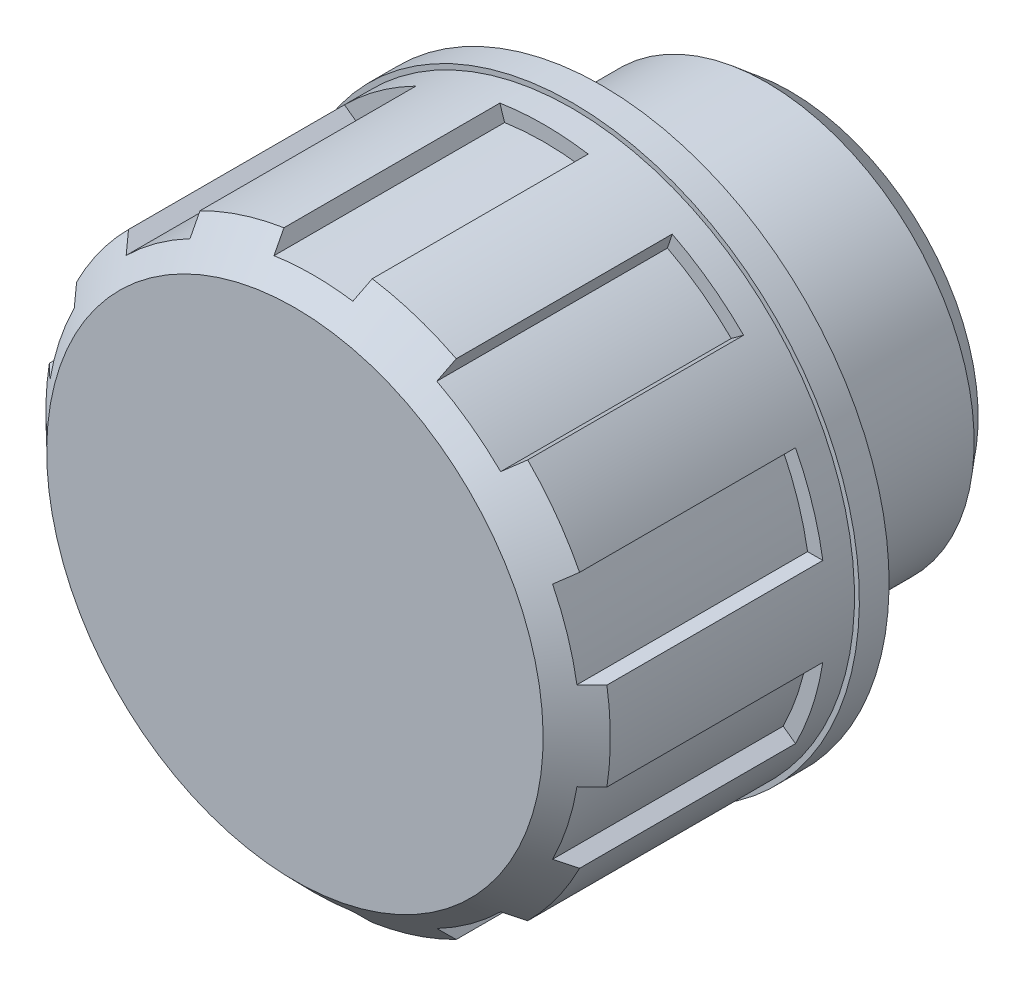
ISO-10303-21;
HEADER;
FILE_DESCRIPTION(('STEP AP214'),'2;1');
FILE_NAME('part.step','',(''),(''),'','','');
FILE_SCHEMA(('AUTOMOTIVE_DESIGN { 1 0 10303 214 1 1 1 1 }'));
ENDSEC;
DATA;
#1=APPLICATION_CONTEXT('core data for automotive mechanical design processes');
#2=APPLICATION_PROTOCOL_DEFINITION('international standard','automotive_design',2000,#1);
#3=PRODUCT_CONTEXT('',#1,'mechanical');
#4=PRODUCT('Part','Part','',(#3));
#5=PRODUCT_RELATED_PRODUCT_CATEGORY('part','',(#4));
#6=PRODUCT_DEFINITION_FORMATION('','',#4);
#7=PRODUCT_DEFINITION_CONTEXT('part definition',#1,'design');
#8=PRODUCT_DEFINITION('design','',#6,#7);
#9=PRODUCT_DEFINITION_SHAPE('','',#8);
#10=(LENGTH_UNIT() NAMED_UNIT(*) SI_UNIT(.MILLI.,.METRE.));
#11=(NAMED_UNIT(*) PLANE_ANGLE_UNIT() SI_UNIT($,.RADIAN.));
#12=(NAMED_UNIT(*) SI_UNIT($,.STERADIAN.) SOLID_ANGLE_UNIT());
#13=UNCERTAINTY_MEASURE_WITH_UNIT(LENGTH_MEASURE(1.E-05),#10,'distance_accuracy_value','');
#14=(GEOMETRIC_REPRESENTATION_CONTEXT(3) GLOBAL_UNCERTAINTY_ASSIGNED_CONTEXT((#13)) GLOBAL_UNIT_ASSIGNED_CONTEXT((#10,
#11,#12)) REPRESENTATION_CONTEXT('',''));
#15=CARTESIAN_POINT('',(0.,0.,0.));
#16=DIRECTION('',(0.,0.,1.));
#17=DIRECTION('',(1.,0.,0.));
#18=AXIS2_PLACEMENT_3D('',#15,#16,#17);
#19=CARTESIAN_POINT('',(0.,0.,13.8270576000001));
#20=DIRECTION('',(0.,0.,-1.));
#21=DIRECTION('',(0.,1.,0.));
#22=AXIS2_PLACEMENT_3D('',#19,#20,#21);
#23=CONICAL_SURFACE('',#22,14.2523853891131,0.797743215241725);
#24=CARTESIAN_POINT('',(0.,0.,15.5035280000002));
#25=DIRECTION('',(0.,0.,-1.));
#26=DIRECTION('',(0.,1.,0.));
#27=AXIS2_PLACEMENT_3D('',#24,#25,#26);
#28=CIRCLE('',#27,12.5340032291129);
#29=CARTESIAN_POINT('',(0.,12.5340032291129,15.5035280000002));
#30=VERTEX_POINT('',#29);
#31=EDGE_CURVE('E302',#30,#30,#28,.T.);
#32=ORIENTED_EDGE('',*,*,#31,.T.);
#33=EDGE_LOOP('',(#32));
#34=FACE_BOUND('',#33,.T.);
#35=CARTESIAN_POINT('',(0.,0.,14.5685210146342));
#36=DIRECTION('',(0.,0.,-1.));
#37=DIRECTION('',(0.,1.,0.));
#38=AXIS2_PLACEMENT_3D('',#35,#36,#37);
#39=CIRCLE('',#38,13.4923853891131);
#40=CARTESIAN_POINT('',(12.0760107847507,-6.01784238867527,14.5685210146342));
#41=VERTEX_POINT('',#40);
#42=CARTESIAN_POINT('',(13.3068969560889,-2.22956428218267,14.5685210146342));
#43=VERTEX_POINT('',#42);
#44=EDGE_CURVE('E9',#41,#43,#39,.F.);
#45=ORIENTED_EDGE('',*,*,#44,.T.);
#46=CARTESIAN_POINT('',(11.0156742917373,-2.22956428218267,16.7669060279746));
#47=CARTESIAN_POINT('',(11.4592910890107,-2.22956428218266,16.3426756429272));
#48=CARTESIAN_POINT('',(11.9024401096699,-2.22956428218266,15.9179569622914));
#49=CARTESIAN_POINT('',(12.7880074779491,-2.22956428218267,15.067759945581));
#50=CARTESIAN_POINT('',(13.2304258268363,-2.22956428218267,14.6422816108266));
#51=CARTESIAN_POINT('',(14.1147378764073,-2.22956428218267,13.7907811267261));
#52=CARTESIAN_POINT('',(14.5566315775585,-2.22956428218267,13.3647589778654));
#53=CARTESIAN_POINT('',(15.440009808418,-2.22956428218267,12.5122891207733));
#54=CARTESIAN_POINT('',(15.881494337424,-2.22956428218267,12.0858414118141));
#55=CARTESIAN_POINT('',(16.3228310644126,-2.22956428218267,11.6592409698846));
#56=B_SPLINE_CURVE_WITH_KNOTS('',3,(#46,#47,#48,#49,#50,#51,#52,#53,#54,#55),.UNSPECIFIED.,.F.,
.F.,(4,2,2,2,4),(0.,1.84143994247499,3.68287668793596,5.52431179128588,7.36575004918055),.UNSPECIFIED.);
#57=CARTESIAN_POINT('',(14.0769148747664,-2.22956428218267,13.8270576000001));
#58=VERTEX_POINT('',#57);
#59=EDGE_CURVE('E585',#43,#58,#56,.T.);
#60=ORIENTED_EDGE('',*,*,#59,.T.);
#61=CARTESIAN_POINT('',(0.,0.,13.8270576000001));
#62=DIRECTION('',(0.,0.,-1.));
#63=DIRECTION('',(0.,1.,0.));
#64=AXIS2_PLACEMENT_3D('',#61,#62,#63);
#65=CIRCLE('',#64,14.2523853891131);
#66=CARTESIAN_POINT('',(14.0769148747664,2.22956428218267,13.8270576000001));
#67=VERTEX_POINT('',#66);
#68=EDGE_CURVE('E599',#67,#58,#65,.T.);
#69=ORIENTED_EDGE('',*,*,#68,.F.);
#70=CARTESIAN_POINT('',(16.3228310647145,2.22956427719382,11.6592409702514));
#71=CARTESIAN_POINT('',(15.8814943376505,2.22956427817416,12.0858414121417));
#72=CARTESIAN_POINT('',(15.4400098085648,2.22956427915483,12.5122891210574));
#73=CARTESIAN_POINT('',(14.5566315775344,2.22956428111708,13.3647589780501));
#74=CARTESIAN_POINT('',(14.1147378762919,2.22956428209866,13.7907811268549));
#75=CARTESIAN_POINT('',(13.2304258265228,2.22956428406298,14.6422816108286));
#76=CARTESIAN_POINT('',(12.7880074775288,2.22956428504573,15.0677599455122));
#77=CARTESIAN_POINT('',(11.902440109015,2.22956428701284,15.9179569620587));
#78=CARTESIAN_POINT('',(11.4592910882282,2.2295642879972,16.3426756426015));
#79=CARTESIAN_POINT('',(11.0156742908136,2.22956428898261,16.7669060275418));
#80=B_SPLINE_CURVE_WITH_KNOTS('',3,(#70,#71,#72,#73,#74,#75,#76,#77,#78,#79),.UNSPECIFIED.,.F.,
.F.,(4,2,2,2,4),(0.,1.84143825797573,3.68287336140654,5.52431010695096,7.36575004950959),.UNSPECIFIED.);
#81=CARTESIAN_POINT('',(13.3068969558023,2.22956428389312,14.5685210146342));
#82=VERTEX_POINT('',#81);
#83=EDGE_CURVE('E279',#67,#82,#80,.T.);
#84=ORIENTED_EDGE('',*,*,#83,.T.);
#85=CARTESIAN_POINT('',(0.,0.,14.5685210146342));
#86=DIRECTION('',(0.,0.,-1.));
#87=DIRECTION('',(0.,1.,0.));
#88=AXIS2_PLACEMENT_3D('',#85,#86,#87);
#89=CIRCLE('',#88,13.4923853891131);
#90=CARTESIAN_POINT('',(12.0760107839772,6.01784239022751,14.5685210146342));
#91=VERTEX_POINT('',#90);
#92=EDGE_CURVE('E312',#82,#91,#89,.F.);
#93=ORIENTED_EDGE('',*,*,#92,.T.);
#94=CARTESIAN_POINT('',(12.0758107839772,6.01769708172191,14.5687588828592));
#95=CARTESIAN_POINT('',(12.1797347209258,6.09320224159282,14.4451553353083));
#96=CARTESIAN_POINT('',(12.2836404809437,6.16869419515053,14.321528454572));
#97=CARTESIAN_POINT('',(12.49141564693,6.31965168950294,14.0742280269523));
#98=CARTESIAN_POINT('',(12.5952850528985,6.3951172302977,13.9505544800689));
#99=CARTESIAN_POINT('',(12.6991362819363,6.4705695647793,13.8268576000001));
#100=B_SPLINE_CURVE_WITH_KNOTS('',3,(#94,#95,#96,#97,#98,#99),.UNSPECIFIED.,.F.,.F.,(4,2,4),(0.,
0.534800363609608,1.06960072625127),.UNSPECIFIED.);
#101=CARTESIAN_POINT('',(12.6989683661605,6.47044756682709,13.8270576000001));
#102=VERTEX_POINT('',#101);
#103=EDGE_CURVE('E526',#91,#102,#100,.T.);
#104=ORIENTED_EDGE('',*,*,#103,.T.);
#105=CARTESIAN_POINT('',(10.0779583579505,10.0779583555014,13.8270576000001));
#106=VERTEX_POINT('',#105);
#107=EDGE_CURVE('E600',#106,#102,#65,.T.);
#108=ORIENTED_EDGE('',*,*,#107,.F.);
#109=CARTESIAN_POINT('',(10.0781262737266,10.0780803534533,13.8268576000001));
#110=CARTESIAN_POINT('',(9.97427504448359,10.0026280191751,13.9505544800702));
#111=CARTESIAN_POINT('',(9.87040563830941,9.9271624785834,14.0742280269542));
#112=CARTESIAN_POINT('',(9.6626304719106,9.77620498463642,14.3215284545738));
#113=CARTESIAN_POINT('',(9.5587247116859,9.70071303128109,14.4451553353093));
#114=CARTESIAN_POINT('',(9.45480077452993,9.62520787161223,14.5687588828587));
#115=B_SPLINE_CURVE_WITH_KNOTS('',3,(#109,#110,#111,#112,#113,#114),.UNSPECIFIED.,.F.,.F.,(4,2,
4),(0.,0.534800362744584,1.06960072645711),.UNSPECIFIED.);
#116=CARTESIAN_POINT('',(9.45500077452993,9.62535318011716,14.5685210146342));
#117=VERTEX_POINT('',#116);
#118=EDGE_CURVE('E835',#106,#117,#115,.T.);
#119=ORIENTED_EDGE('',*,*,#118,.T.);
#120=CARTESIAN_POINT('',(0.,0.,14.5685210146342));
#121=DIRECTION('',(0.,0.,-1.));
#122=DIRECTION('',(0.,1.,0.));
#123=AXIS2_PLACEMENT_3D('',#120,#121,#122);
#124=CIRCLE('',#123,13.4923853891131);
#125=CARTESIAN_POINT('',(6.23249894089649,11.9666378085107,14.5685210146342));
#126=VERTEX_POINT('',#125);
#127=EDGE_CURVE('E317',#117,#126,#124,.F.);
#128=ORIENTED_EDGE('',*,*,#127,.T.);
#129=CARTESIAN_POINT('',(6.23243395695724,11.9664378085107,14.5687233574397));
#130=CARTESIAN_POINT('',(6.27212746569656,12.0886018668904,14.4451257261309));
#131=CARTESIAN_POINT('',(6.31181403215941,12.2107445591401,14.3215047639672));
#132=CARTESIAN_POINT('',(6.39117328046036,12.4549872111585,14.0742161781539));
#133=CARTESIAN_POINT('',(6.43084596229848,12.5770871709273,13.9505485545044));
#134=CARTESIAN_POINT('',(6.47051170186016,12.6991657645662,13.8268576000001));
#135=B_SPLINE_CURVE_WITH_KNOTS('',3,(#129,#130,#131,#132,#133,#134),.UNSPECIFIED.,.F.,.F.,(4,2,
4),(0.,0.534774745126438,1.06954948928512),.UNSPECIFIED.);
#136=CARTESIAN_POINT('',(6.47044756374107,12.698968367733,13.8270576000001));
#137=VERTEX_POINT('',#136);
#138=EDGE_CURVE('E810',#126,#137,#135,.T.);
#139=ORIENTED_EDGE('',*,*,#138,.T.);
#140=CARTESIAN_POINT('',(2.22956428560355,14.0769148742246,13.8270576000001));
#141=VERTEX_POINT('',#140);
#142=EDGE_CURVE('E308',#141,#137,#65,.T.);
#143=ORIENTED_EDGE('',*,*,#142,.F.);
#144=CARTESIAN_POINT('',(2.2296284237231,14.0771122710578,13.8268576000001));
#145=CARTESIAN_POINT('',(2.18996268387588,13.9550336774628,13.9505485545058));
#146=CARTESIAN_POINT('',(2.15029000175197,13.8329337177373,14.074216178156));
#147=CARTESIAN_POINT('',(2.07093075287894,13.5886910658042,14.3215047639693));
#148=CARTESIAN_POINT('',(2.03124418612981,13.4665483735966,14.4451257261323));
#149=CARTESIAN_POINT('',(1.99155067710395,13.3443843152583,14.5687233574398));
#150=B_SPLINE_CURVE_WITH_KNOTS('',3,(#144,#145,#146,#147,#148,#149),.UNSPECIFIED.,.F.,.F.,(4,2,
4),(0.,0.534774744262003,1.06954948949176),.UNSPECIFIED.);
#151=CARTESIAN_POINT('',(1.99161566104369,13.3445843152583,14.5685210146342));
#152=VERTEX_POINT('',#151);
#153=EDGE_CURVE('E802',#141,#152,#150,.T.);
#154=ORIENTED_EDGE('',*,*,#153,.T.);
#155=CARTESIAN_POINT('',(0.,0.,14.5685210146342));
#156=DIRECTION('',(0.,0.,-1.));
#157=DIRECTION('',(0.,1.,0.));
#158=AXIS2_PLACEMENT_3D('',#155,#156,#157);
#159=CIRCLE('',#158,13.4923853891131);
#160=CARTESIAN_POINT('',(-1.99161566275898,13.3445843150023,14.5685210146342));
#161=VERTEX_POINT('',#160);
#162=EDGE_CURVE('E864',#152,#161,#159,.F.);
#163=ORIENTED_EDGE('',*,*,#162,.T.);
#164=CARTESIAN_POINT('',(-1.99155067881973,13.3443843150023,14.5687233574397));
#165=CARTESIAN_POINT('',(-2.03124418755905,13.466548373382,14.4451257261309));
#166=CARTESIAN_POINT('',(-2.0709307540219,13.5886910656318,14.3215047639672));
#167=CARTESIAN_POINT('',(-2.15029000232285,13.8329337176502,14.0742161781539));
#168=CARTESIAN_POINT('',(-2.18996268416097,13.955033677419,13.9505485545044));
#169=CARTESIAN_POINT('',(-2.22962842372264,14.0771122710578,13.8268576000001));
#170=B_SPLINE_CURVE_WITH_KNOTS('',3,(#164,#165,#166,#167,#168,#169),.UNSPECIFIED.,.F.,.F.,(4,2,
4),(0.,0.534774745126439,1.06954948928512),.UNSPECIFIED.);
#171=CARTESIAN_POINT('',(-2.22956428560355,14.0769148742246,13.8270576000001));
#172=VERTEX_POINT('',#171);
#173=EDGE_CURVE('E796',#161,#172,#170,.T.);
#174=ORIENTED_EDGE('',*,*,#173,.T.);
#175=CARTESIAN_POINT('',(-6.47044756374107,12.6989683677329,13.8270576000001));
#176=VERTEX_POINT('',#175);
#177=EDGE_CURVE('E606',#176,#172,#65,.T.);
#178=ORIENTED_EDGE('',*,*,#177,.F.);
#179=CARTESIAN_POINT('',(-6.47051170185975,12.6991657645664,13.8268576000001));
#180=CARTESIAN_POINT('',(-6.43084596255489,12.5770871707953,13.9505485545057));
#181=CARTESIAN_POINT('',(-6.39117328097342,12.4549872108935,14.0742161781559));
#182=CARTESIAN_POINT('',(-6.3118140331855,12.210744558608,14.3215047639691));
#183=CARTESIAN_POINT('',(-6.27212746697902,12.0886018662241,14.445125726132));
#184=CARTESIAN_POINT('',(-6.23243395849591,11.9664378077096,14.5687233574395));
#185=B_SPLINE_CURVE_WITH_KNOTS('',3,(#179,#180,#181,#182,#183,#184),.UNSPECIFIED.,.F.,.F.,(4,2,
4),(0.,0.534774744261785,1.06954948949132),.UNSPECIFIED.);
#186=CARTESIAN_POINT('',(-6.23249894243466,11.9666378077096,14.5685210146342));
#187=VERTEX_POINT('',#186);
#188=EDGE_CURVE('E29',#176,#187,#185,.T.);
#189=ORIENTED_EDGE('',*,*,#188,.T.);
#190=CARTESIAN_POINT('',(0.,0.,14.5685210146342));
#191=DIRECTION('',(0.,0.,-1.));
#192=DIRECTION('',(0.,1.,0.));
#193=AXIS2_PLACEMENT_3D('',#190,#191,#192);
#194=CIRCLE('',#193,13.4923853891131);
#195=CARTESIAN_POINT('',(-9.45500077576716,9.62535317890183,14.5685210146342));
#196=VERTEX_POINT('',#195);
#197=EDGE_CURVE('E866',#187,#196,#194,.F.);
#198=ORIENTED_EDGE('',*,*,#197,.T.);
#199=CARTESIAN_POINT('',(-9.45480077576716,9.62520787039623,14.5687588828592));
#200=CARTESIAN_POINT('',(-9.55872471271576,9.70071303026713,14.4451553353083));
#201=CARTESIAN_POINT('',(-9.66263047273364,9.77620498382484,14.321528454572));
#202=CARTESIAN_POINT('',(-9.87040563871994,9.92716247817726,14.0742280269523));
#203=CARTESIAN_POINT('',(-9.97427504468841,10.002628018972,13.9505544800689));
#204=CARTESIAN_POINT('',(-10.0781262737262,10.0780803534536,13.8268576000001));
#205=B_SPLINE_CURVE_WITH_KNOTS('',3,(#199,#200,#201,#202,#203,#204),.UNSPECIFIED.,.F.,.F.,(4,2,
4),(0.,0.534800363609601,1.06960072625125),.UNSPECIFIED.);
#206=CARTESIAN_POINT('',(-10.0779583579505,10.0779583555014,13.8270576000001));
#207=VERTEX_POINT('',#206);
#208=EDGE_CURVE('E764',#196,#207,#205,.T.);
#209=ORIENTED_EDGE('',*,*,#208,.T.);
#210=CARTESIAN_POINT('',(-12.6989683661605,6.47044756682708,13.8270576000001));
#211=VERTEX_POINT('',#210);
#212=EDGE_CURVE('E959',#211,#207,#65,.T.);
#213=ORIENTED_EDGE('',*,*,#212,.F.);
#214=CARTESIAN_POINT('',(-12.6991362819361,6.47056956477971,13.8268576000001));
#215=CARTESIAN_POINT('',(-12.5952850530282,6.39511723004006,13.9505544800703));
#216=CARTESIAN_POINT('',(-12.4914156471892,6.31965168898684,14.0742280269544));
#217=CARTESIAN_POINT('',(-12.2836404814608,6.16869419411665,14.3215284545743));
#218=CARTESIAN_POINT('',(-12.1797347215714,6.09320224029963,14.4451553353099));
#219=CARTESIAN_POINT('',(-12.0758107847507,6.01769708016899,14.5687588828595));
#220=B_SPLINE_CURVE_WITH_KNOTS('',3,(#214,#215,#216,#217,#218,#219),.UNSPECIFIED.,.F.,.F.,(4,2,
4),(0.,0.534800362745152,1.06960072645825),.UNSPECIFIED.);
#221=CARTESIAN_POINT('',(-12.0760107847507,6.01784238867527,14.5685210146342));
#222=VERTEX_POINT('',#221);
#223=EDGE_CURVE('E37',#211,#222,#220,.T.);
#224=ORIENTED_EDGE('',*,*,#223,.T.);
#225=CARTESIAN_POINT('',(0.,0.,14.5685210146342));
#226=DIRECTION('',(0.,0.,-1.));
#227=DIRECTION('',(0.,1.,0.));
#228=AXIS2_PLACEMENT_3D('',#225,#226,#227);
#229=CIRCLE('',#228,13.4923853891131);
#230=CARTESIAN_POINT('',(-13.3068969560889,2.22956428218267,14.5685210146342));
#231=VERTEX_POINT('',#230);
#232=EDGE_CURVE('E871',#222,#231,#229,.F.);
#233=ORIENTED_EDGE('',*,*,#232,.T.);
#234=CARTESIAN_POINT('',(-11.2161160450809,2.22956428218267,16.5751721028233));
#235=CARTESIAN_POINT('',(-11.6595862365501,2.22956428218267,16.1507887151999));
#236=CARTESIAN_POINT('',(-12.1026117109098,2.22956428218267,15.7259413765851));
#237=CARTESIAN_POINT('',(-12.9879659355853,2.22956428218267,14.875522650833));
#238=CARTESIAN_POINT('',(-13.4302946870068,2.22956428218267,14.449951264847));
#239=CARTESIAN_POINT('',(-14.314449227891,2.22956428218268,13.5982872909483));
#240=CARTESIAN_POINT('',(-14.7562750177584,2.22956428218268,13.1721947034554));
#241=CARTESIAN_POINT('',(-15.63953314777,2.22956428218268,12.3196005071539));
#242=CARTESIAN_POINT('',(-16.080965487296,2.22956428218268,11.8930988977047));
#243=CARTESIAN_POINT('',(-16.5222549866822,2.22956428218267,11.4664497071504));
#244=B_SPLINE_CURVE_WITH_KNOTS('',3,(#234,#235,#236,#237,#238,#239,#240,#241,#242,#243),
.UNSPECIFIED.,.F.,.F.,(4,2,2,2,4),(0.,1.84143954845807,3.68287617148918,5.52431131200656,
7.36574934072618),.UNSPECIFIED.);
#245=CARTESIAN_POINT('',(-14.0769148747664,2.22956428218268,13.8270576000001));
#246=VERTEX_POINT('',#245);
#247=EDGE_CURVE('E751',#231,#246,#244,.T.);
#248=ORIENTED_EDGE('',*,*,#247,.T.);
#249=CARTESIAN_POINT('',(-14.0769148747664,-2.22956428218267,13.8270576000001));
#250=VERTEX_POINT('',#249);
#251=EDGE_CURVE('E956',#250,#246,#65,.T.);
#252=ORIENTED_EDGE('',*,*,#251,.F.);
#253=CARTESIAN_POINT('',(-16.5222549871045,-2.22956427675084,11.4664497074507));
#254=CARTESIAN_POINT('',(-16.0809654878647,-2.22956427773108,11.8930988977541));
#255=CARTESIAN_POINT('',(-15.6395331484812,-2.22956427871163,12.3196005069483));
#256=CARTESIAN_POINT('',(-14.7562750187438,-2.22956428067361,13.1721947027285));
#257=CARTESIAN_POINT('',(-14.3144492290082,-2.22956428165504,13.598287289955));
#258=CARTESIAN_POINT('',(-13.4302946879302,-2.22956428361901,14.449951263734));
#259=CARTESIAN_POINT('',(-12.9879659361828,-2.22956428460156,14.875522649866));
#260=CARTESIAN_POINT('',(-12.102611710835,-2.2295642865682,15.7259413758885));
#261=CARTESIAN_POINT('',(-11.6595862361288,-2.22956428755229,16.1507887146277));
#262=CARTESIAN_POINT('',(-11.2161160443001,-2.22956428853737,16.5751721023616));
#263=B_SPLINE_CURVE_WITH_KNOTS('',3,(#253,#254,#255,#256,#257,#258,#259,#260,#261,#262),
.UNSPECIFIED.,.F.,.F.,(4,2,2,2,4),(0.,1.84143802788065,3.6828731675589,5.52430979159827,
7.36574934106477),.UNSPECIFIED.);
#264=CARTESIAN_POINT('',(-13.3068969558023,-2.22956428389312,14.5685210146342));
#265=VERTEX_POINT('',#264);
#266=EDGE_CURVE('E744',#250,#265,#263,.T.);
#267=ORIENTED_EDGE('',*,*,#266,.T.);
#268=CARTESIAN_POINT('',(0.,0.,14.5685210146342));
#269=DIRECTION('',(0.,0.,-1.));
#270=DIRECTION('',(0.,1.,0.));
#271=AXIS2_PLACEMENT_3D('',#268,#269,#270);
#272=CIRCLE('',#271,13.4923853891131);
#273=CARTESIAN_POINT('',(-12.0760107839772,-6.0178423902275,14.5685210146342));
#274=VERTEX_POINT('',#273);
#275=EDGE_CURVE('E874',#265,#274,#272,.F.);
#276=ORIENTED_EDGE('',*,*,#275,.T.);
#277=CARTESIAN_POINT('',(-12.0758107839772,-6.0176970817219,14.5687588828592));
#278=CARTESIAN_POINT('',(-12.1797347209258,-6.09320224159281,14.4451553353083));
#279=CARTESIAN_POINT('',(-12.2836404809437,-6.16869419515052,14.321528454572));
#280=CARTESIAN_POINT('',(-12.49141564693,-6.31965168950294,14.0742280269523));
#281=CARTESIAN_POINT('',(-12.5952850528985,-6.39511723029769,13.9505544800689));
#282=CARTESIAN_POINT('',(-12.6991362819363,-6.4705695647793,13.8268576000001));
#283=B_SPLINE_CURVE_WITH_KNOTS('',3,(#277,#278,#279,#280,#281,#282),.UNSPECIFIED.,.F.,.F.,(4,2,
4),(0.,0.53480036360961,1.06960072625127),.UNSPECIFIED.);
#284=CARTESIAN_POINT('',(-12.6989683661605,-6.47044756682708,13.8270576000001));
#285=VERTEX_POINT('',#284);
#286=EDGE_CURVE('E714',#274,#285,#283,.T.);
#287=ORIENTED_EDGE('',*,*,#286,.T.);
#288=CARTESIAN_POINT('',(-10.0779583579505,-10.0779583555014,13.8270576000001));
#289=VERTEX_POINT('',#288);
#290=EDGE_CURVE('E954',#289,#285,#65,.T.);
#291=ORIENTED_EDGE('',*,*,#290,.F.);
#292=CARTESIAN_POINT('',(-10.0781262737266,-10.0780803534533,13.8268576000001));
#293=CARTESIAN_POINT('',(-9.97427504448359,-10.0026280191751,13.9505544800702));
#294=CARTESIAN_POINT('',(-9.87040563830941,-9.9271624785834,14.0742280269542));
#295=CARTESIAN_POINT('',(-9.6626304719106,-9.77620498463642,14.3215284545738));
#296=CARTESIAN_POINT('',(-9.5587247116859,-9.70071303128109,14.4451553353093));
#297=CARTESIAN_POINT('',(-9.45480077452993,-9.62520787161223,14.5687588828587));
#298=B_SPLINE_CURVE_WITH_KNOTS('',3,(#292,#293,#294,#295,#296,#297),.UNSPECIFIED.,.F.,.F.,(4,2,
4),(0.,0.534800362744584,1.06960072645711),.UNSPECIFIED.);
#299=CARTESIAN_POINT('',(-9.45500077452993,-9.62535318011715,14.5685210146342));
#300=VERTEX_POINT('',#299);
#301=EDGE_CURVE('E706',#289,#300,#298,.T.);
#302=ORIENTED_EDGE('',*,*,#301,.T.);
#303=CARTESIAN_POINT('',(0.,0.,14.5685210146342));
#304=DIRECTION('',(0.,0.,-1.));
#305=DIRECTION('',(0.,1.,0.));
#306=AXIS2_PLACEMENT_3D('',#303,#304,#305);
#307=CIRCLE('',#306,13.4923853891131);
#308=CARTESIAN_POINT('',(-6.23249894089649,-11.9666378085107,14.5685210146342));
#309=VERTEX_POINT('',#308);
#310=EDGE_CURVE('E877',#300,#309,#307,.F.);
#311=ORIENTED_EDGE('',*,*,#310,.T.);
#312=CARTESIAN_POINT('',(-6.23243395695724,-11.9664378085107,14.5687233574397));
#313=CARTESIAN_POINT('',(-6.27212746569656,-12.0886018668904,14.4451257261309));
#314=CARTESIAN_POINT('',(-6.31181403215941,-12.2107445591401,14.3215047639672));
#315=CARTESIAN_POINT('',(-6.39117328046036,-12.4549872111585,14.0742161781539));
#316=CARTESIAN_POINT('',(-6.43084596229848,-12.5770871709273,13.9505485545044));
#317=CARTESIAN_POINT('',(-6.47051170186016,-12.6991657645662,13.8268576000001));
#318=B_SPLINE_CURVE_WITH_KNOTS('',3,(#312,#313,#314,#315,#316,#317),.UNSPECIFIED.,.F.,.F.,(4,2,
4),(0.,0.534774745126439,1.06954948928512),.UNSPECIFIED.);
#319=CARTESIAN_POINT('',(-6.47044756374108,-12.6989683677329,13.8270576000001));
#320=VERTEX_POINT('',#319);
#321=EDGE_CURVE('E699',#309,#320,#318,.T.);
#322=ORIENTED_EDGE('',*,*,#321,.T.);
#323=CARTESIAN_POINT('',(-2.22956428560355,-14.0769148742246,13.8270576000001));
#324=VERTEX_POINT('',#323);
#325=EDGE_CURVE('E955',#324,#320,#65,.T.);
#326=ORIENTED_EDGE('',*,*,#325,.F.);
#327=CARTESIAN_POINT('',(-2.2296284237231,-14.0771122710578,13.8268576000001));
#328=CARTESIAN_POINT('',(-2.18996268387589,-13.9550336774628,13.9505485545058));
#329=CARTESIAN_POINT('',(-2.15029000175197,-13.8329337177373,14.074216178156));
#330=CARTESIAN_POINT('',(-2.07093075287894,-13.5886910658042,14.3215047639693));
#331=CARTESIAN_POINT('',(-2.03124418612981,-13.4665483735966,14.4451257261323));
#332=CARTESIAN_POINT('',(-1.99155067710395,-13.3443843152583,14.5687233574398));
#333=B_SPLINE_CURVE_WITH_KNOTS('',3,(#327,#328,#329,#330,#331,#332),.UNSPECIFIED.,.F.,.F.,(4,2,
4),(0.,0.534774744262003,1.06954948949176),.UNSPECIFIED.);
#334=CARTESIAN_POINT('',(-1.99161566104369,-13.3445843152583,14.5685210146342));
#335=VERTEX_POINT('',#334);
#336=EDGE_CURVE('E692',#324,#335,#333,.T.);
#337=ORIENTED_EDGE('',*,*,#336,.T.);
#338=CARTESIAN_POINT('',(0.,0.,14.5685210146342));
#339=DIRECTION('',(0.,0.,-1.));
#340=DIRECTION('',(0.,1.,0.));
#341=AXIS2_PLACEMENT_3D('',#338,#339,#340);
#342=CIRCLE('',#341,13.4923853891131);
#343=CARTESIAN_POINT('',(1.99161566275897,-13.3445843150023,14.5685210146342));
#344=VERTEX_POINT('',#343);
#345=EDGE_CURVE('E880',#335,#344,#342,.F.);
#346=ORIENTED_EDGE('',*,*,#345,.T.);
#347=CARTESIAN_POINT('',(1.99155067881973,-13.3443843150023,14.5687233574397));
#348=CARTESIAN_POINT('',(2.03124418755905,-13.466548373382,14.4451257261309));
#349=CARTESIAN_POINT('',(2.07093075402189,-13.5886910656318,14.3215047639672));
#350=CARTESIAN_POINT('',(2.15029000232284,-13.8329337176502,14.0742161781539));
#351=CARTESIAN_POINT('',(2.18996268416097,-13.955033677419,13.9505485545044));
#352=CARTESIAN_POINT('',(2.22962842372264,-14.0771122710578,13.8268576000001));
#353=B_SPLINE_CURVE_WITH_KNOTS('',3,(#347,#348,#349,#350,#351,#352),.UNSPECIFIED.,.F.,.F.,(4,2,
4),(0.,0.534774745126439,1.06954948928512),.UNSPECIFIED.);
#354=CARTESIAN_POINT('',(2.22956428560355,-14.0769148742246,13.8270576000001));
#355=VERTEX_POINT('',#354);
#356=EDGE_CURVE('E666',#344,#355,#353,.T.);
#357=ORIENTED_EDGE('',*,*,#356,.T.);
#358=CARTESIAN_POINT('',(6.47044756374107,-12.6989683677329,13.8270576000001));
#359=VERTEX_POINT('',#358);
#360=EDGE_CURVE('E604',#359,#355,#65,.T.);
#361=ORIENTED_EDGE('',*,*,#360,.F.);
#362=CARTESIAN_POINT('',(6.47051170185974,-12.6991657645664,13.8268576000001));
#363=CARTESIAN_POINT('',(6.43084596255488,-12.5770871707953,13.9505485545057));
#364=CARTESIAN_POINT('',(6.39117328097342,-12.4549872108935,14.0742161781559));
#365=CARTESIAN_POINT('',(6.3118140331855,-12.210744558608,14.3215047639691));
#366=CARTESIAN_POINT('',(6.27212746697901,-12.0886018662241,14.445125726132));
#367=CARTESIAN_POINT('',(6.2324339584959,-11.9664378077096,14.5687233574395));
#368=B_SPLINE_CURVE_WITH_KNOTS('',3,(#362,#363,#364,#365,#366,#367),.UNSPECIFIED.,.F.,.F.,(4,2,
4),(0.,0.534774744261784,1.06954948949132),.UNSPECIFIED.);
#369=CARTESIAN_POINT('',(6.23249894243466,-11.9666378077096,14.5685210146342));
#370=VERTEX_POINT('',#369);
#371=EDGE_CURVE('E659',#359,#370,#368,.T.);
#372=ORIENTED_EDGE('',*,*,#371,.T.);
#373=CARTESIAN_POINT('',(0.,0.,14.5685210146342));
#374=DIRECTION('',(0.,0.,-1.));
#375=DIRECTION('',(0.,1.,0.));
#376=AXIS2_PLACEMENT_3D('',#373,#374,#375);
#377=CIRCLE('',#376,13.4923853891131);
#378=CARTESIAN_POINT('',(9.45500077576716,-9.62535317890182,14.5685210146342));
#379=VERTEX_POINT('',#378);
#380=EDGE_CURVE('E22',#370,#379,#377,.F.);
#381=ORIENTED_EDGE('',*,*,#380,.T.);
#382=CARTESIAN_POINT('',(9.45480077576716,-9.62520787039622,14.5687588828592));
#383=CARTESIAN_POINT('',(9.55872471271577,-9.70071303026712,14.4451553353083));
#384=CARTESIAN_POINT('',(9.66263047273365,-9.77620498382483,14.321528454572));
#385=CARTESIAN_POINT('',(9.87040563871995,-9.92716247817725,14.0742280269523));
#386=CARTESIAN_POINT('',(9.97427504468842,-10.002628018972,13.9505544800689));
#387=CARTESIAN_POINT('',(10.0781262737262,-10.0780803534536,13.8268576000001));
#388=B_SPLINE_CURVE_WITH_KNOTS('',3,(#382,#383,#384,#385,#386,#387),.UNSPECIFIED.,.F.,.F.,(4,2,
4),(0.,0.534800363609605,1.06960072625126),.UNSPECIFIED.);
#389=CARTESIAN_POINT('',(10.0779583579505,-10.0779583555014,13.8270576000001));
#390=VERTEX_POINT('',#389);
#391=EDGE_CURVE('E652',#379,#390,#388,.T.);
#392=ORIENTED_EDGE('',*,*,#391,.T.);
#393=CARTESIAN_POINT('',(12.6989683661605,-6.47044756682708,13.8270576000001));
#394=VERTEX_POINT('',#393);
#395=EDGE_CURVE('E601',#394,#390,#65,.T.);
#396=ORIENTED_EDGE('',*,*,#395,.F.);
#397=CARTESIAN_POINT('',(12.6991362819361,-6.47056956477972,13.8268576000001));
#398=CARTESIAN_POINT('',(12.5952850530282,-6.39511723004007,13.9505544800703));
#399=CARTESIAN_POINT('',(12.4914156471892,-6.31965168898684,14.0742280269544));
#400=CARTESIAN_POINT('',(12.2836404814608,-6.16869419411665,14.3215284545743));
#401=CARTESIAN_POINT('',(12.1797347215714,-6.09320224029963,14.44515533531));
#402=CARTESIAN_POINT('',(12.0758107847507,-6.01769708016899,14.5687588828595));
#403=B_SPLINE_CURVE_WITH_KNOTS('',3,(#397,#398,#399,#400,#401,#402),.UNSPECIFIED.,.F.,.F.,(4,2,
4),(0.,0.53480036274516,1.06960072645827),.UNSPECIFIED.);
#404=EDGE_CURVE('E587',#394,#41,#403,.T.);
#405=ORIENTED_EDGE('',*,*,#404,.T.);
#406=EDGE_LOOP('',(#45,#60,#69,#84,#93,#104,#108,#119,#128,#139,#143,#154,#163,#174,#178,#189,
#198,#209,#213,#224,#233,#248,#252,#267,#276,#287,#291,#302,#311,#322,#326,#337,#346,#357,#361,
#372,#381,#392,#396,#405));
#407=FACE_BOUND('',#406,.T.);
#408=ADVANCED_FACE('F14',(#34,#407),#23,.T.);
#409=CARTESIAN_POINT('',(0.,0.,-9.49840328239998));
#410=DIRECTION('',(0.,0.,-1.));
#411=DIRECTION('',(0.,1.,0.));
#412=AXIS2_PLACEMENT_3D('',#409,#410,#411);
#413=CYLINDRICAL_SURFACE('',#412,14.2523853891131);
#414=ORIENTED_EDGE('',*,*,#68,.T.);
#415=DIRECTION('',(0.,0.,1.));
#416=VECTOR('',#415,1.);
#417=CARTESIAN_POINT('',(14.0769148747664,-2.22956428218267,2.92352800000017));
#418=LINE('',#417,#416);
#419=CARTESIAN_POINT('',(14.0769148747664,-2.22956428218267,2.92352800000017));
#420=VERTEX_POINT('',#419);
#421=EDGE_CURVE('E429',#420,#58,#418,.T.);
#422=ORIENTED_EDGE('',*,*,#421,.F.);
#423=CARTESIAN_POINT('',(0.,0.,2.92352800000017));
#424=DIRECTION('',(0.,0.,1.));
#425=DIRECTION('',(0.,-1.,0.));
#426=AXIS2_PLACEMENT_3D('',#423,#424,#425);
#427=CIRCLE('',#426,14.2523853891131);
#428=CARTESIAN_POINT('',(12.6989683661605,-6.47044756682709,2.92352800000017));
#429=VERTEX_POINT('',#428);
#430=EDGE_CURVE('E304',#420,#429,#427,.F.);
#431=ORIENTED_EDGE('',*,*,#430,.T.);
#432=DIRECTION('',(0.,0.,1.));
#433=VECTOR('',#432,1.);
#434=CARTESIAN_POINT('',(12.6989683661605,-6.47044756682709,2.92352800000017));
#435=LINE('',#434,#433);
#436=EDGE_CURVE('E437',#429,#394,#435,.T.);
#437=ORIENTED_EDGE('',*,*,#436,.T.);
#438=ORIENTED_EDGE('',*,*,#395,.T.);
#439=DIRECTION('',(0.,0.,1.));
#440=VECTOR('',#439,1.);
#441=CARTESIAN_POINT('',(10.0779583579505,-10.0779583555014,2.92352800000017));
#442=LINE('',#441,#440);
#443=CARTESIAN_POINT('',(10.0779583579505,-10.0779583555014,2.92352800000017));
#444=VERTEX_POINT('',#443);
#445=EDGE_CURVE('E439',#444,#390,#442,.T.);
#446=ORIENTED_EDGE('',*,*,#445,.F.);
#447=CARTESIAN_POINT('',(6.47044756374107,-12.698968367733,2.92352800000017));
#448=VERTEX_POINT('',#447);
#449=EDGE_CURVE('E313',#444,#448,#427,.F.);
#450=ORIENTED_EDGE('',*,*,#449,.T.);
#451=DIRECTION('',(0.,0.,1.));
#452=VECTOR('',#451,1.);
#453=CARTESIAN_POINT('',(6.47044756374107,-12.698968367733,2.92352800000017));
#454=LINE('',#453,#452);
#455=EDGE_CURVE('E447',#448,#359,#454,.T.);
#456=ORIENTED_EDGE('',*,*,#455,.T.);
#457=ORIENTED_EDGE('',*,*,#360,.T.);
#458=DIRECTION('',(0.,0.,1.));
#459=VECTOR('',#458,1.);
#460=CARTESIAN_POINT('',(2.22956428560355,-14.0769148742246,2.92352800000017));
#461=LINE('',#460,#459);
#462=CARTESIAN_POINT('',(2.22956428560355,-14.0769148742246,2.92352800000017));
#463=VERTEX_POINT('',#462);
#464=EDGE_CURVE('E449',#463,#355,#461,.T.);
#465=ORIENTED_EDGE('',*,*,#464,.F.);
#466=CARTESIAN_POINT('',(-2.22956428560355,-14.0769148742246,2.92352800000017));
#467=VERTEX_POINT('',#466);
#468=EDGE_CURVE('E319',#463,#467,#427,.F.);
#469=ORIENTED_EDGE('',*,*,#468,.T.);
#470=DIRECTION('',(0.,0.,1.));
#471=VECTOR('',#470,1.);
#472=CARTESIAN_POINT('',(-2.22956428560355,-14.0769148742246,2.92352800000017));
#473=LINE('',#472,#471);
#474=EDGE_CURVE('E457',#467,#324,#473,.T.);
#475=ORIENTED_EDGE('',*,*,#474,.T.);
#476=ORIENTED_EDGE('',*,*,#325,.T.);
#477=DIRECTION('',(0.,0.,1.));
#478=VECTOR('',#477,1.);
#479=CARTESIAN_POINT('',(-6.47044756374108,-12.6989683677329,2.92352800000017));
#480=LINE('',#479,#478);
#481=CARTESIAN_POINT('',(-6.47044756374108,-12.6989683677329,2.92352800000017));
#482=VERTEX_POINT('',#481);
#483=EDGE_CURVE('E459',#482,#320,#480,.T.);
#484=ORIENTED_EDGE('',*,*,#483,.F.);
#485=CARTESIAN_POINT('',(-10.0779583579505,-10.0779583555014,2.92352800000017));
#486=VERTEX_POINT('',#485);
#487=EDGE_CURVE('E323',#482,#486,#427,.F.);
#488=ORIENTED_EDGE('',*,*,#487,.T.);
#489=DIRECTION('',(0.,0.,1.));
#490=VECTOR('',#489,1.);
#491=CARTESIAN_POINT('',(-10.0779583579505,-10.0779583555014,2.92352800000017));
#492=LINE('',#491,#490);
#493=EDGE_CURVE('E467',#486,#289,#492,.T.);
#494=ORIENTED_EDGE('',*,*,#493,.T.);
#495=ORIENTED_EDGE('',*,*,#290,.T.);
#496=DIRECTION('',(0.,0.,1.));
#497=VECTOR('',#496,1.);
#498=CARTESIAN_POINT('',(-12.6989683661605,-6.47044756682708,2.92352800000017));
#499=LINE('',#498,#497);
#500=CARTESIAN_POINT('',(-12.6989683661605,-6.47044756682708,2.92352800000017));
#501=VERTEX_POINT('',#500);
#502=EDGE_CURVE('E469',#501,#285,#499,.T.);
#503=ORIENTED_EDGE('',*,*,#502,.F.);
#504=CARTESIAN_POINT('',(-14.0769148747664,-2.22956428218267,2.92352800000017));
#505=VERTEX_POINT('',#504);
#506=EDGE_CURVE('E327',#501,#505,#427,.F.);
#507=ORIENTED_EDGE('',*,*,#506,.T.);
#508=DIRECTION('',(0.,0.,1.));
#509=VECTOR('',#508,1.);
#510=CARTESIAN_POINT('',(-14.0769148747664,-2.22956428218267,2.92352800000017));
#511=LINE('',#510,#509);
#512=EDGE_CURVE('E477',#505,#250,#511,.T.);
#513=ORIENTED_EDGE('',*,*,#512,.T.);
#514=ORIENTED_EDGE('',*,*,#251,.T.);
#515=DIRECTION('',(0.,0.,1.));
#516=VECTOR('',#515,1.);
#517=CARTESIAN_POINT('',(-14.0769148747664,2.22956428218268,2.92352800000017));
#518=LINE('',#517,#516);
#519=CARTESIAN_POINT('',(-14.0769148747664,2.22956428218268,2.92352800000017));
#520=VERTEX_POINT('',#519);
#521=EDGE_CURVE('E479',#520,#246,#518,.T.);
#522=ORIENTED_EDGE('',*,*,#521,.F.);
#523=CARTESIAN_POINT('',(-12.6989683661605,6.47044756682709,2.92352800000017));
#524=VERTEX_POINT('',#523);
#525=EDGE_CURVE('E331',#520,#524,#427,.F.);
#526=ORIENTED_EDGE('',*,*,#525,.T.);
#527=DIRECTION('',(0.,0.,1.));
#528=VECTOR('',#527,1.);
#529=CARTESIAN_POINT('',(-12.6989683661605,6.47044756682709,2.92352800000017));
#530=LINE('',#529,#528);
#531=EDGE_CURVE('E486',#524,#211,#530,.T.);
#532=ORIENTED_EDGE('',*,*,#531,.T.);
#533=ORIENTED_EDGE('',*,*,#212,.T.);
#534=DIRECTION('',(0.,0.,1.));
#535=VECTOR('',#534,1.);
#536=CARTESIAN_POINT('',(-10.0779583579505,10.0779583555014,2.92352800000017));
#537=LINE('',#536,#535);
#538=CARTESIAN_POINT('',(-10.0779583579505,10.0779583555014,2.92352800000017));
#539=VERTEX_POINT('',#538);
#540=EDGE_CURVE('E488',#539,#207,#537,.T.);
#541=ORIENTED_EDGE('',*,*,#540,.F.);
#542=CARTESIAN_POINT('',(-6.47044756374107,12.698968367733,2.92352800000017));
#543=VERTEX_POINT('',#542);
#544=EDGE_CURVE('E335',#539,#543,#427,.F.);
#545=ORIENTED_EDGE('',*,*,#544,.T.);
#546=DIRECTION('',(0.,0.,1.));
#547=VECTOR('',#546,1.);
#548=CARTESIAN_POINT('',(-6.47044756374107,12.698968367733,2.92352800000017));
#549=LINE('',#548,#547);
#550=EDGE_CURVE('E495',#543,#176,#549,.T.);
#551=ORIENTED_EDGE('',*,*,#550,.T.);
#552=ORIENTED_EDGE('',*,*,#177,.T.);
#553=DIRECTION('',(0.,0.,1.));
#554=VECTOR('',#553,1.);
#555=CARTESIAN_POINT('',(-2.22956428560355,14.0769148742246,2.92352800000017));
#556=LINE('',#555,#554);
#557=CARTESIAN_POINT('',(-2.22956428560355,14.0769148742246,2.92352800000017));
#558=VERTEX_POINT('',#557);
#559=EDGE_CURVE('E346',#558,#172,#556,.T.);
#560=ORIENTED_EDGE('',*,*,#559,.F.);
#561=CARTESIAN_POINT('',(2.22956428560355,14.0769148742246,2.92352800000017));
#562=VERTEX_POINT('',#561);
#563=EDGE_CURVE('E306',#558,#562,#427,.F.);
#564=ORIENTED_EDGE('',*,*,#563,.T.);
#565=DIRECTION('',(0.,0.,1.));
#566=VECTOR('',#565,1.);
#567=CARTESIAN_POINT('',(2.22956428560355,14.0769148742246,2.92352800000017));
#568=LINE('',#567,#566);
#569=EDGE_CURVE('E343',#562,#141,#568,.T.);
#570=ORIENTED_EDGE('',*,*,#569,.T.);
#571=ORIENTED_EDGE('',*,*,#142,.T.);
#572=DIRECTION('',(0.,0.,1.));
#573=VECTOR('',#572,1.);
#574=CARTESIAN_POINT('',(6.47044756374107,12.698968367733,2.92352800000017));
#575=LINE('',#574,#573);
#576=CARTESIAN_POINT('',(6.47044756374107,12.698968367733,2.92352800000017));
#577=VERTEX_POINT('',#576);
#578=EDGE_CURVE('E503',#577,#137,#575,.T.);
#579=ORIENTED_EDGE('',*,*,#578,.F.);
#580=CARTESIAN_POINT('',(10.0779583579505,10.0779583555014,2.92352800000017));
#581=VERTEX_POINT('',#580);
#582=EDGE_CURVE('E301',#577,#581,#427,.F.);
#583=ORIENTED_EDGE('',*,*,#582,.T.);
#584=DIRECTION('',(0.,0.,1.));
#585=VECTOR('',#584,1.);
#586=CARTESIAN_POINT('',(10.0779583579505,10.0779583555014,2.92352800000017));
#587=LINE('',#586,#585);
#588=EDGE_CURVE('E511',#581,#106,#587,.T.);
#589=ORIENTED_EDGE('',*,*,#588,.T.);
#590=ORIENTED_EDGE('',*,*,#107,.T.);
#591=DIRECTION('',(0.,0.,1.));
#592=VECTOR('',#591,1.);
#593=CARTESIAN_POINT('',(12.6989683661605,6.47044756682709,2.92352800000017));
#594=LINE('',#593,#592);
#595=CARTESIAN_POINT('',(12.6989683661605,6.47044756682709,2.92352800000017));
#596=VERTEX_POINT('',#595);
#597=EDGE_CURVE('E300',#596,#102,#594,.T.);
#598=ORIENTED_EDGE('',*,*,#597,.F.);
#599=CARTESIAN_POINT('',(14.0769148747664,2.22956428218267,2.92352800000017));
#600=VERTEX_POINT('',#599);
#601=EDGE_CURVE('E290',#596,#600,#427,.F.);
#602=ORIENTED_EDGE('',*,*,#601,.T.);
#603=DIRECTION('',(0.,0.,1.));
#604=VECTOR('',#603,1.);
#605=CARTESIAN_POINT('',(14.0769148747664,2.22956428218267,2.92352800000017));
#606=LINE('',#605,#604);
#607=EDGE_CURVE('E273',#600,#67,#606,.T.);
#608=ORIENTED_EDGE('',*,*,#607,.T.);
#609=EDGE_LOOP('',(#414,#422,#431,#437,#438,#446,#450,#456,#457,#465,#469,#475,#476,#484,#488,
#494,#495,#503,#507,#513,#514,#522,#526,#532,#533,#541,#545,#551,#552,#560,#564,#570,#571,#579,
#583,#589,#590,#598,#602,#608));
#610=FACE_BOUND('',#609,.T.);
#611=CARTESIAN_POINT('',(0.,0.,1.5));
#612=DIRECTION('',(0.,0.,-1.));
#613=DIRECTION('',(0.,1.,0.));
#614=AXIS2_PLACEMENT_3D('',#611,#612,#613);
#615=CIRCLE('',#614,14.2523853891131);
#616=CARTESIAN_POINT('',(0.,14.2523853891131,1.5));
#617=VERTEX_POINT('',#616);
#618=EDGE_CURVE('E607',#617,#617,#615,.T.);
#619=ORIENTED_EDGE('',*,*,#618,.F.);
#620=EDGE_LOOP('',(#619));
#621=FACE_BOUND('',#620,.T.);
#622=ADVANCED_FACE('F297',(#610,#621),#413,.T.);
#623=CARTESIAN_POINT('',(0.,0.,-9.49840328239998));
#624=DIRECTION('',(0.,0.,-1.));
#625=DIRECTION('',(0.,1.,0.));
#626=AXIS2_PLACEMENT_3D('',#623,#624,#625);
#627=PLANE('',#626);
#628=CARTESIAN_POINT('',(0.,0.,-9.49840328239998));
#629=DIRECTION('',(0.,0.,-1.));
#630=DIRECTION('',(0.,1.,0.));
#631=AXIS2_PLACEMENT_3D('',#628,#629,#630);
#632=CIRCLE('',#631,9.50097069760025);
#633=CARTESIAN_POINT('',(0.,9.50097069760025,-9.49840328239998));
#634=VERTEX_POINT('',#633);
#635=EDGE_CURVE('E622',#634,#634,#632,.T.);
#636=ORIENTED_EDGE('',*,*,#635,.T.);
#637=EDGE_LOOP('',(#636));
#638=FACE_BOUND('',#637,.T.);
#639=ADVANCED_FACE('F16',(#638),#627,.T.);
#640=CARTESIAN_POINT('',(0.,0.,15.5035280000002));
#641=DIRECTION('',(0.,0.,1.));
#642=DIRECTION('',(0.,-1.,0.));
#643=AXIS2_PLACEMENT_3D('',#640,#641,#642);
#644=PLANE('',#643);
#645=ORIENTED_EDGE('',*,*,#31,.F.);
#646=EDGE_LOOP('',(#645));
#647=FACE_BOUND('',#646,.T.);
#648=ADVANCED_FACE('F567',(#647),#644,.T.);
#649=CARTESIAN_POINT('',(14.2523853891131,0.,1.5));
#650=DIRECTION('',(0.,0.,1.));
#651=DIRECTION('',(0.,-1.,0.));
#652=AXIS2_PLACEMENT_3D('',#649,#650,#651);
#653=PLANE('',#652);
#654=ORIENTED_EDGE('',*,*,#618,.T.);
#655=EDGE_LOOP('',(#654));
#656=FACE_BOUND('',#655,.T.);
#657=CARTESIAN_POINT('',(0.,0.,1.5));
#658=DIRECTION('',(0.,0.,-1.));
#659=DIRECTION('',(0.,1.,0.));
#660=AXIS2_PLACEMENT_3D('',#657,#658,#659);
#661=CIRCLE('',#660,14.5);
#662=CARTESIAN_POINT('',(0.,14.5,1.5));
#663=VERTEX_POINT('',#662);
#664=EDGE_CURVE('E610',#663,#663,#661,.T.);
#665=ORIENTED_EDGE('',*,*,#664,.F.);
#666=EDGE_LOOP('',(#665));
#667=FACE_BOUND('',#666,.T.);
#668=ADVANCED_FACE('F564',(#656,#667),#653,.T.);
#669=CARTESIAN_POINT('',(0.,0.,-9.49840328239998));
#670=DIRECTION('',(0.,0.,-1.));
#671=DIRECTION('',(0.,1.,0.));
#672=AXIS2_PLACEMENT_3D('',#669,#670,#671);
#673=CYLINDRICAL_SURFACE('',#672,14.5);
#674=ORIENTED_EDGE('',*,*,#664,.T.);
#675=EDGE_LOOP('',(#674));
#676=FACE_BOUND('',#675,.T.);
#677=CARTESIAN_POINT('',(0.,0.,0.));
#678=DIRECTION('',(0.,0.,-1.));
#679=DIRECTION('',(0.,1.,0.));
#680=AXIS2_PLACEMENT_3D('',#677,#678,#679);
#681=CIRCLE('',#680,14.5);
#682=CARTESIAN_POINT('',(0.,14.5,0.));
#683=VERTEX_POINT('',#682);
#684=EDGE_CURVE('E613',#683,#683,#681,.T.);
#685=ORIENTED_EDGE('',*,*,#684,.F.);
#686=EDGE_LOOP('',(#685));
#687=FACE_BOUND('',#686,.T.);
#688=ADVANCED_FACE('F560',(#676,#687),#673,.T.);
#689=CARTESIAN_POINT('',(14.5,0.,0.));
#690=DIRECTION('',(0.,0.,-1.));
#691=DIRECTION('',(0.,1.,0.));
#692=AXIS2_PLACEMENT_3D('',#689,#690,#691);
#693=PLANE('',#692);
#694=ORIENTED_EDGE('',*,*,#684,.T.);
#695=EDGE_LOOP('',(#694));
#696=FACE_BOUND('',#695,.T.);
#697=CARTESIAN_POINT('',(0.,0.,0.));
#698=DIRECTION('',(0.,0.,-1.));
#699=DIRECTION('',(0.,1.,0.));
#700=AXIS2_PLACEMENT_3D('',#697,#698,#699);
#701=CIRCLE('',#700,10.475);
#702=CARTESIAN_POINT('',(0.,10.475,0.));
#703=VERTEX_POINT('',#702);
#704=EDGE_CURVE('E616',#703,#703,#701,.T.);
#705=ORIENTED_EDGE('',*,*,#704,.F.);
#706=EDGE_LOOP('',(#705));
#707=FACE_BOUND('',#706,.T.);
#708=ADVANCED_FACE('F556',(#696,#707),#693,.T.);
#709=CARTESIAN_POINT('',(0.,0.,-9.49840328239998));
#710=DIRECTION('',(0.,0.,-1.));
#711=DIRECTION('',(0.,1.,0.));
#712=AXIS2_PLACEMENT_3D('',#709,#710,#711);
#713=CYLINDRICAL_SURFACE('',#712,10.475);
#714=ORIENTED_EDGE('',*,*,#704,.T.);
#715=EDGE_LOOP('',(#714));
#716=FACE_BOUND('',#715,.T.);
#717=CARTESIAN_POINT('',(0.,0.,-8.31959722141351));
#718=DIRECTION('',(0.,0.,-1.));
#719=DIRECTION('',(0.,1.,0.));
#720=AXIS2_PLACEMENT_3D('',#717,#718,#719);
#721=CIRCLE('',#720,10.475);
#722=CARTESIAN_POINT('',(0.,10.475,-8.31959722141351));
#723=VERTEX_POINT('',#722);
#724=EDGE_CURVE('E619',#723,#723,#721,.T.);
#725=ORIENTED_EDGE('',*,*,#724,.F.);
#726=EDGE_LOOP('',(#725));
#727=FACE_BOUND('',#726,.T.);
#728=ADVANCED_FACE('F552',(#716,#727),#713,.T.);
#729=CARTESIAN_POINT('',(0.,0.,-9.49840328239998));
#730=DIRECTION('',(0.,0.,1.));
#731=DIRECTION('',(0.,-1.,0.));
#732=AXIS2_PLACEMENT_3D('',#729,#730,#731);
#733=CONICAL_SURFACE('',#732,9.50097069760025,0.690563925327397);
#734=ORIENTED_EDGE('',*,*,#724,.T.);
#735=EDGE_LOOP('',(#734));
#736=FACE_BOUND('',#735,.T.);
#737=ORIENTED_EDGE('',*,*,#635,.F.);
#738=EDGE_LOOP('',(#737));
#739=FACE_BOUND('',#738,.T.);
#740=ADVANCED_FACE('F540',(#736,#739),#733,.T.);
#741=CARTESIAN_POINT('',(14.0769148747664,2.22956428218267,2.92352800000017));
#742=DIRECTION('',(2.22130001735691E-09,1.,0.));
#743=DIRECTION('',(-1.,2.22130001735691E-09,0.));
#744=AXIS2_PLACEMENT_3D('',#741,#742,#743);
#745=PLANE('',#744);
#746=ORIENTED_EDGE('',*,*,#607,.F.);
#747=DIRECTION('',(-1.,2.22130001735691E-09,0.));
#748=VECTOR('',#747,1.);
#749=CARTESIAN_POINT('',(14.0769148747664,2.22956428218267,2.92352800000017));
#750=LINE('',#749,#748);
#751=CARTESIAN_POINT('',(13.3068969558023,2.22956428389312,2.92352800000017));
#752=VERTEX_POINT('',#751);
#753=EDGE_CURVE('E277',#600,#752,#750,.T.);
#754=ORIENTED_EDGE('',*,*,#753,.T.);
#755=DIRECTION('',(0.,0.,1.));
#756=VECTOR('',#755,1.);
#757=CARTESIAN_POINT('',(13.3068969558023,2.22956428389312,2.92352800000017));
#758=LINE('',#757,#756);
#759=EDGE_CURVE('E284',#752,#82,#758,.T.);
#760=ORIENTED_EDGE('',*,*,#759,.T.);
#761=ORIENTED_EDGE('',*,*,#83,.F.);
#762=EDGE_LOOP('',(#746,#754,#760,#761));
#763=FACE_BOUND('',#762,.T.);
#764=ADVANCED_FACE('F275',(#763),#745,.T.);
#765=CARTESIAN_POINT('',(12.6989683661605,6.47044756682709,2.92352800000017));
#766=DIRECTION('',(0.587785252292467,-0.809016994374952,0.));
#767=DIRECTION('',(0.809016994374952,0.587785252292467,0.));
#768=AXIS2_PLACEMENT_3D('',#765,#766,#767);
#769=PLANE('',#768);
#770=DIRECTION('',(0.,0.,1.));
#771=VECTOR('',#770,1.);
#772=CARTESIAN_POINT('',(12.0760107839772,6.01784239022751,2.92352800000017));
#773=LINE('',#772,#771);
#774=CARTESIAN_POINT('',(12.0760107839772,6.01784239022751,2.92352800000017));
#775=VERTEX_POINT('',#774);
#776=EDGE_CURVE('E515',#775,#91,#773,.T.);
#777=ORIENTED_EDGE('',*,*,#776,.F.);
#778=DIRECTION('',(0.809016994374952,0.587785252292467,0.));
#779=VECTOR('',#778,1.);
#780=CARTESIAN_POINT('',(12.6989683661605,6.47044756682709,2.92352800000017));
#781=LINE('',#780,#779);
#782=EDGE_CURVE('E856',#775,#596,#781,.T.);
#783=ORIENTED_EDGE('',*,*,#782,.T.);
#784=ORIENTED_EDGE('',*,*,#597,.T.);
#785=ORIENTED_EDGE('',*,*,#103,.F.);
#786=EDGE_LOOP('',(#777,#783,#784,#785));
#787=FACE_BOUND('',#786,.T.);
#788=ADVANCED_FACE('F539',(#787),#769,.T.);
#789=CARTESIAN_POINT('',(3.89555054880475E-09,0.,2.92352800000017));
#790=DIRECTION('',(0.,0.,1.));
#791=DIRECTION('',(0.,-1.,0.));
#792=AXIS2_PLACEMENT_3D('',#789,#790,#791);
#793=PLANE('',#792);
#794=ORIENTED_EDGE('',*,*,#782,.F.);
#795=CARTESIAN_POINT('',(0.,0.,2.92352800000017));
#796=DIRECTION('',(0.,0.,1.));
#797=DIRECTION('',(0.,-1.,0.));
#798=AXIS2_PLACEMENT_3D('',#795,#796,#797);
#799=CIRCLE('',#798,13.4923853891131);
#800=EDGE_CURVE('E293',#752,#775,#799,.T.);
#801=ORIENTED_EDGE('',*,*,#800,.F.);
#802=ORIENTED_EDGE('',*,*,#753,.F.);
#803=ORIENTED_EDGE('',*,*,#601,.F.);
#804=EDGE_LOOP('',(#794,#801,#802,#803));
#805=FACE_BOUND('',#804,.T.);
#806=ADVANCED_FACE('F289',(#805),#793,.T.);
#807=CARTESIAN_POINT('',(0.,0.,2.92352800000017));
#808=DIRECTION('',(0.,0.,1.));
#809=DIRECTION('',(0.,-1.,0.));
#810=AXIS2_PLACEMENT_3D('',#807,#808,#809);
#811=CYLINDRICAL_SURFACE('',#810,13.4923853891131);
#812=ORIENTED_EDGE('',*,*,#759,.F.);
#813=ORIENTED_EDGE('',*,*,#800,.T.);
#814=ORIENTED_EDGE('',*,*,#776,.T.);
#815=ORIENTED_EDGE('',*,*,#92,.F.);
#816=EDGE_LOOP('',(#812,#813,#814,#815));
#817=FACE_BOUND('',#816,.T.);
#818=ADVANCED_FACE('F541',(#817),#811,.T.);
#819=CARTESIAN_POINT('',(10.0779583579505,10.0779583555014,2.92352800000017));
#820=DIRECTION('',(-0.587785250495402,0.809016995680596,0.));
#821=DIRECTION('',(-0.809016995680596,-0.587785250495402,0.));
#822=AXIS2_PLACEMENT_3D('',#819,#820,#821);
#823=PLANE('',#822);
#824=ORIENTED_EDGE('',*,*,#588,.F.);
#825=DIRECTION('',(-0.809016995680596,-0.587785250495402,0.));
#826=VECTOR('',#825,1.);
#827=CARTESIAN_POINT('',(10.0779583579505,10.0779583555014,2.92352800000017));
#828=LINE('',#827,#826);
#829=CARTESIAN_POINT('',(9.45500077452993,9.62535318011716,2.92352800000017));
#830=VERTEX_POINT('',#829);
#831=EDGE_CURVE('E849',#581,#830,#828,.T.);
#832=ORIENTED_EDGE('',*,*,#831,.T.);
#833=DIRECTION('',(0.,0.,1.));
#834=VECTOR('',#833,1.);
#835=CARTESIAN_POINT('',(9.45500077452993,9.62535318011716,2.92352800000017));
#836=LINE('',#835,#834);
#837=EDGE_CURVE('E508',#830,#117,#836,.T.);
#838=ORIENTED_EDGE('',*,*,#837,.T.);
#839=ORIENTED_EDGE('',*,*,#118,.F.);
#840=EDGE_LOOP('',(#824,#832,#838,#839));
#841=FACE_BOUND('',#840,.T.);
#842=ADVANCED_FACE('F826',(#841),#823,.T.);
#843=CARTESIAN_POINT('',(6.47044756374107,12.698968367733,2.92352800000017));
#844=DIRECTION('',(0.951056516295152,-0.309016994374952,0.));
#845=DIRECTION('',(0.309016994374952,0.951056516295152,0.));
#846=AXIS2_PLACEMENT_3D('',#843,#844,#845);
#847=PLANE('',#846);
#848=DIRECTION('',(0.,0.,1.));
#849=VECTOR('',#848,1.);
#850=CARTESIAN_POINT('',(6.23249894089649,11.9666378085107,2.92352800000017));
#851=LINE('',#850,#849);
#852=CARTESIAN_POINT('',(6.23249894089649,11.9666378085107,2.92352800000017));
#853=VERTEX_POINT('',#852);
#854=EDGE_CURVE('E505',#853,#126,#851,.T.);
#855=ORIENTED_EDGE('',*,*,#854,.F.);
#856=DIRECTION('',(0.309016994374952,0.951056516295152,0.));
#857=VECTOR('',#856,1.);
#858=CARTESIAN_POINT('',(6.47044756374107,12.698968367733,2.92352800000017));
#859=LINE('',#858,#857);
#860=EDGE_CURVE('E858',#853,#577,#859,.T.);
#861=ORIENTED_EDGE('',*,*,#860,.T.);
#862=ORIENTED_EDGE('',*,*,#578,.T.);
#863=ORIENTED_EDGE('',*,*,#138,.F.);
#864=EDGE_LOOP('',(#855,#861,#862,#863));
#865=FACE_BOUND('',#864,.T.);
#866=ADVANCED_FACE('F821',(#865),#847,.T.);
#867=ORIENTED_EDGE('',*,*,#860,.F.);
#868=CARTESIAN_POINT('',(0.,0.,2.92352800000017));
#869=DIRECTION('',(0.,0.,1.));
#870=DIRECTION('',(0.,-1.,0.));
#871=AXIS2_PLACEMENT_3D('',#868,#869,#870);
#872=CIRCLE('',#871,13.4923853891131);
#873=EDGE_CURVE('E855',#830,#853,#872,.T.);
#874=ORIENTED_EDGE('',*,*,#873,.F.);
#875=ORIENTED_EDGE('',*,*,#831,.F.);
#876=ORIENTED_EDGE('',*,*,#582,.F.);
#877=EDGE_LOOP('',(#867,#874,#875,#876));
#878=FACE_BOUND('',#877,.T.);
#879=ADVANCED_FACE('F825',(#878),#793,.T.);
#880=CARTESIAN_POINT('',(0.,0.,2.92352800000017));
#881=DIRECTION('',(0.,0.,1.));
#882=DIRECTION('',(0.,-1.,0.));
#883=AXIS2_PLACEMENT_3D('',#880,#881,#882);
#884=CYLINDRICAL_SURFACE('',#883,13.4923853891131);
#885=ORIENTED_EDGE('',*,*,#837,.F.);
#886=ORIENTED_EDGE('',*,*,#873,.T.);
#887=ORIENTED_EDGE('',*,*,#854,.T.);
#888=ORIENTED_EDGE('',*,*,#127,.F.);
#889=EDGE_LOOP('',(#885,#886,#887,#888));
#890=FACE_BOUND('',#889,.T.);
#891=ADVANCED_FACE('F819',(#890),#884,.T.);
#892=CARTESIAN_POINT('',(2.22956428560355,14.0769148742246,2.92352800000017));
#893=DIRECTION('',(-0.951056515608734,0.309016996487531,0.));
#894=DIRECTION('',(-0.309016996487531,-0.951056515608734,0.));
#895=AXIS2_PLACEMENT_3D('',#892,#893,#894);
#896=PLANE('',#895);
#897=ORIENTED_EDGE('',*,*,#569,.F.);
#898=DIRECTION('',(-0.309016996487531,-0.951056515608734,0.));
#899=VECTOR('',#898,1.);
#900=CARTESIAN_POINT('',(2.22956428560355,14.0769148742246,2.92352800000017));
#901=LINE('',#900,#899);
#902=CARTESIAN_POINT('',(1.99161566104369,13.3445843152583,2.92352800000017));
#903=VERTEX_POINT('',#902);
#904=EDGE_CURVE('E356',#562,#903,#901,.T.);
#905=ORIENTED_EDGE('',*,*,#904,.T.);
#906=DIRECTION('',(0.,0.,1.));
#907=VECTOR('',#906,1.);
#908=CARTESIAN_POINT('',(1.99161566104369,13.3445843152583,2.92352800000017));
#909=LINE('',#908,#907);
#910=EDGE_CURVE('E499',#903,#152,#909,.T.);
#911=ORIENTED_EDGE('',*,*,#910,.T.);
#912=ORIENTED_EDGE('',*,*,#153,.F.);
#913=EDGE_LOOP('',(#897,#905,#911,#912));
#914=FACE_BOUND('',#913,.T.);
#915=ADVANCED_FACE('F816',(#914),#896,.T.);
#916=CARTESIAN_POINT('',(-2.22956428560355,14.0769148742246,2.92352800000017));
#917=DIRECTION('',(0.951056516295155,0.309016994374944,0.));
#918=DIRECTION('',(-0.309016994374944,0.951056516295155,0.));
#919=AXIS2_PLACEMENT_3D('',#916,#917,#918);
#920=PLANE('',#919);
#921=DIRECTION('',(0.,0.,1.));
#922=VECTOR('',#921,1.);
#923=CARTESIAN_POINT('',(-1.99161566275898,13.3445843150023,2.92352800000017));
#924=LINE('',#923,#922);
#925=CARTESIAN_POINT('',(-1.99161566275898,13.3445843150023,2.92352800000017));
#926=VERTEX_POINT('',#925);
#927=EDGE_CURVE('E361',#926,#161,#924,.T.);
#928=ORIENTED_EDGE('',*,*,#927,.F.);
#929=DIRECTION('',(-0.309016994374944,0.951056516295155,0.));
#930=VECTOR('',#929,1.);
#931=CARTESIAN_POINT('',(-2.22956428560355,14.0769148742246,2.92352800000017));
#932=LINE('',#931,#930);
#933=EDGE_CURVE('E353',#926,#558,#932,.T.);
#934=ORIENTED_EDGE('',*,*,#933,.T.);
#935=ORIENTED_EDGE('',*,*,#559,.T.);
#936=ORIENTED_EDGE('',*,*,#173,.F.);
#937=EDGE_LOOP('',(#928,#934,#935,#936));
#938=FACE_BOUND('',#937,.T.);
#939=ADVANCED_FACE('F358',(#938),#920,.T.);
#940=ORIENTED_EDGE('',*,*,#933,.F.);
#941=CARTESIAN_POINT('',(0.,0.,2.92352800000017));
#942=DIRECTION('',(0.,0.,1.));
#943=DIRECTION('',(0.,-1.,0.));
#944=AXIS2_PLACEMENT_3D('',#941,#942,#943);
#945=CIRCLE('',#944,13.4923853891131);
#946=EDGE_CURVE('E363',#903,#926,#945,.T.);
#947=ORIENTED_EDGE('',*,*,#946,.F.);
#948=ORIENTED_EDGE('',*,*,#904,.F.);
#949=ORIENTED_EDGE('',*,*,#563,.F.);
#950=EDGE_LOOP('',(#940,#947,#948,#949));
#951=FACE_BOUND('',#950,.T.);
#952=ADVANCED_FACE('F351',(#951),#793,.T.);
#953=CARTESIAN_POINT('',(0.,0.,2.92352800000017));
#954=DIRECTION('',(0.,0.,1.));
#955=DIRECTION('',(0.,-1.,0.));
#956=AXIS2_PLACEMENT_3D('',#953,#954,#955);
#957=CYLINDRICAL_SURFACE('',#956,13.4923853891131);
#958=ORIENTED_EDGE('',*,*,#910,.F.);
#959=ORIENTED_EDGE('',*,*,#946,.T.);
#960=ORIENTED_EDGE('',*,*,#927,.T.);
#961=ORIENTED_EDGE('',*,*,#162,.F.);
#962=EDGE_LOOP('',(#958,#959,#960,#961));
#963=FACE_BOUND('',#962,.T.);
#964=ADVANCED_FACE('F788',(#963),#957,.T.);
#965=CARTESIAN_POINT('',(-6.47044756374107,12.698968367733,2.92352800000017));
#966=DIRECTION('',(-0.951056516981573,-0.309016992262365,0.));
#967=DIRECTION('',(0.309016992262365,-0.951056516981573,0.));
#968=AXIS2_PLACEMENT_3D('',#965,#966,#967);
#969=PLANE('',#968);
#970=ORIENTED_EDGE('',*,*,#550,.F.);
#971=DIRECTION('',(0.309016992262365,-0.951056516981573,0.));
#972=VECTOR('',#971,1.);
#973=CARTESIAN_POINT('',(-6.47044756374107,12.698968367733,2.92352800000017));
#974=LINE('',#973,#972);
#975=CARTESIAN_POINT('',(-6.23249894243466,11.9666378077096,2.92352800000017));
#976=VERTEX_POINT('',#975);
#977=EDGE_CURVE('E362',#543,#976,#974,.T.);
#978=ORIENTED_EDGE('',*,*,#977,.T.);
#979=DIRECTION('',(0.,0.,1.));
#980=VECTOR('',#979,1.);
#981=CARTESIAN_POINT('',(-6.23249894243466,11.9666378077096,2.92352800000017));
#982=LINE('',#981,#980);
#983=EDGE_CURVE('E493',#976,#187,#982,.T.);
#984=ORIENTED_EDGE('',*,*,#983,.T.);
#985=ORIENTED_EDGE('',*,*,#188,.F.);
#986=EDGE_LOOP('',(#970,#978,#984,#985));
#987=FACE_BOUND('',#986,.T.);
#988=ADVANCED_FACE('F780',(#987),#969,.T.);
#989=CARTESIAN_POINT('',(-10.0779583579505,10.0779583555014,2.92352800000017));
#990=DIRECTION('',(0.587785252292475,0.809016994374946,0.));
#991=DIRECTION('',(-0.809016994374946,0.587785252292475,0.));
#992=AXIS2_PLACEMENT_3D('',#989,#990,#991);
#993=PLANE('',#992);
#994=DIRECTION('',(0.,0.,1.));
#995=VECTOR('',#994,1.);
#996=CARTESIAN_POINT('',(-9.45500077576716,9.62535317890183,2.92352800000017));
#997=LINE('',#996,#995);
#998=CARTESIAN_POINT('',(-9.45500077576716,9.62535317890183,2.92352800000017));
#999=VERTEX_POINT('',#998);
#1000=EDGE_CURVE('E490',#999,#196,#997,.T.);
#1001=ORIENTED_EDGE('',*,*,#1000,.F.);
#1002=DIRECTION('',(-0.809016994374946,0.587785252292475,0.));
#1003=VECTOR('',#1002,1.);
#1004=CARTESIAN_POINT('',(-10.0779583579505,10.0779583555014,2.92352800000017));
#1005=LINE('',#1004,#1003);
#1006=EDGE_CURVE('E373',#999,#539,#1005,.T.);
#1007=ORIENTED_EDGE('',*,*,#1006,.T.);
#1008=ORIENTED_EDGE('',*,*,#540,.T.);
#1009=ORIENTED_EDGE('',*,*,#208,.F.);
#1010=EDGE_LOOP('',(#1001,#1007,#1008,#1009));
#1011=FACE_BOUND('',#1010,.T.);
#1012=ADVANCED_FACE('F775',(#1011),#993,.T.);
#1013=ORIENTED_EDGE('',*,*,#1006,.F.);
#1014=CARTESIAN_POINT('',(0.,0.,2.92352800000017));
#1015=DIRECTION('',(0.,0.,1.));
#1016=DIRECTION('',(0.,-1.,0.));
#1017=AXIS2_PLACEMENT_3D('',#1014,#1015,#1016);
#1018=CIRCLE('',#1017,13.4923853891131);
#1019=EDGE_CURVE('E366',#976,#999,#1018,.T.);
#1020=ORIENTED_EDGE('',*,*,#1019,.F.);
#1021=ORIENTED_EDGE('',*,*,#977,.F.);
#1022=ORIENTED_EDGE('',*,*,#544,.F.);
#1023=EDGE_LOOP('',(#1013,#1020,#1021,#1022));
#1024=FACE_BOUND('',#1023,.T.);
#1025=ADVANCED_FACE('F779',(#1024),#793,.T.);
#1026=CARTESIAN_POINT('',(0.,0.,2.92352800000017));
#1027=DIRECTION('',(0.,0.,1.));
#1028=DIRECTION('',(0.,-1.,0.));
#1029=AXIS2_PLACEMENT_3D('',#1026,#1027,#1028);
#1030=CYLINDRICAL_SURFACE('',#1029,13.4923853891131);
#1031=ORIENTED_EDGE('',*,*,#983,.F.);
#1032=ORIENTED_EDGE('',*,*,#1019,.T.);
#1033=ORIENTED_EDGE('',*,*,#1000,.T.);
#1034=ORIENTED_EDGE('',*,*,#197,.F.);
#1035=EDGE_LOOP('',(#1031,#1032,#1033,#1034));
#1036=FACE_BOUND('',#1035,.T.);
#1037=ADVANCED_FACE('F774',(#1036),#1030,.T.);
#1038=CARTESIAN_POINT('',(-12.6989683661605,6.47044756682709,2.92352800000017));
#1039=DIRECTION('',(-0.587785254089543,-0.8090169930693,0.));
#1040=DIRECTION('',(0.8090169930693,-0.587785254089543,0.));
#1041=AXIS2_PLACEMENT_3D('',#1038,#1039,#1040);
#1042=PLANE('',#1041);
#1043=ORIENTED_EDGE('',*,*,#531,.F.);
#1044=DIRECTION('',(0.8090169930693,-0.587785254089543,0.));
#1045=VECTOR('',#1044,1.);
#1046=CARTESIAN_POINT('',(-12.6989683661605,6.47044756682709,2.92352800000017));
#1047=LINE('',#1046,#1045);
#1048=CARTESIAN_POINT('',(-12.0760107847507,6.01784238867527,2.92352800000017));
#1049=VERTEX_POINT('',#1048);
#1050=EDGE_CURVE('E376',#524,#1049,#1047,.T.);
#1051=ORIENTED_EDGE('',*,*,#1050,.T.);
#1052=DIRECTION('',(0.,0.,1.));
#1053=VECTOR('',#1052,1.);
#1054=CARTESIAN_POINT('',(-12.0760107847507,6.01784238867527,2.92352800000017));
#1055=LINE('',#1054,#1053);
#1056=EDGE_CURVE('E484',#1049,#222,#1055,.T.);
#1057=ORIENTED_EDGE('',*,*,#1056,.T.);
#1058=ORIENTED_EDGE('',*,*,#223,.F.);
#1059=EDGE_LOOP('',(#1043,#1051,#1057,#1058));
#1060=FACE_BOUND('',#1059,.T.);
#1061=ADVANCED_FACE('F771',(#1060),#1042,.T.);
#1062=CARTESIAN_POINT('',(-14.0769148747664,2.22956428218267,2.92352800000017));
#1063=DIRECTION('',(0.,1.,0.));
#1064=DIRECTION('',(-1.,0.,0.));
#1065=AXIS2_PLACEMENT_3D('',#1062,#1063,#1064);
#1066=PLANE('',#1065);
#1067=DIRECTION('',(0.,0.,1.));
#1068=VECTOR('',#1067,1.);
#1069=CARTESIAN_POINT('',(-13.3068969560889,2.22956428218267,2.92352800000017));
#1070=LINE('',#1069,#1068);
#1071=CARTESIAN_POINT('',(-13.3068969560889,2.22956428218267,2.92352800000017));
#1072=VERTEX_POINT('',#1071);
#1073=EDGE_CURVE('E481',#1072,#231,#1070,.T.);
#1074=ORIENTED_EDGE('',*,*,#1073,.F.);
#1075=DIRECTION('',(-1.,0.,0.));
#1076=VECTOR('',#1075,1.);
#1077=CARTESIAN_POINT('',(-14.0769148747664,2.22956428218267,2.92352800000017));
#1078=LINE('',#1077,#1076);
#1079=EDGE_CURVE('E382',#1072,#520,#1078,.T.);
#1080=ORIENTED_EDGE('',*,*,#1079,.T.);
#1081=ORIENTED_EDGE('',*,*,#521,.T.);
#1082=ORIENTED_EDGE('',*,*,#247,.F.);
#1083=EDGE_LOOP('',(#1074,#1080,#1081,#1082));
#1084=FACE_BOUND('',#1083,.T.);
#1085=ADVANCED_FACE('F741',(#1084),#1066,.T.);
#1086=ORIENTED_EDGE('',*,*,#1079,.F.);
#1087=CARTESIAN_POINT('',(0.,0.,2.92352800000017));
#1088=DIRECTION('',(0.,0.,1.));
#1089=DIRECTION('',(0.,-1.,0.));
#1090=AXIS2_PLACEMENT_3D('',#1087,#1088,#1089);
#1091=CIRCLE('',#1090,13.4923853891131);
#1092=EDGE_CURVE('E379',#1049,#1072,#1091,.T.);
#1093=ORIENTED_EDGE('',*,*,#1092,.F.);
#1094=ORIENTED_EDGE('',*,*,#1050,.F.);
#1095=ORIENTED_EDGE('',*,*,#525,.F.);
#1096=EDGE_LOOP('',(#1086,#1093,#1094,#1095));
#1097=FACE_BOUND('',#1096,.T.);
#1098=ADVANCED_FACE('F918',(#1097),#793,.T.);
#1099=CARTESIAN_POINT('',(0.,0.,2.92352800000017));
#1100=DIRECTION('',(0.,0.,1.));
#1101=DIRECTION('',(0.,-1.,0.));
#1102=AXIS2_PLACEMENT_3D('',#1099,#1100,#1101);
#1103=CYLINDRICAL_SURFACE('',#1102,13.4923853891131);
#1104=ORIENTED_EDGE('',*,*,#1056,.F.);
#1105=ORIENTED_EDGE('',*,*,#1092,.T.);
#1106=ORIENTED_EDGE('',*,*,#1073,.T.);
#1107=ORIENTED_EDGE('',*,*,#232,.F.);
#1108=EDGE_LOOP('',(#1104,#1105,#1106,#1107));
#1109=FACE_BOUND('',#1108,.T.);
#1110=ADVANCED_FACE('F739',(#1109),#1103,.T.);
#1111=CARTESIAN_POINT('',(-14.0769148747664,-2.22956428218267,2.92352800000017));
#1112=DIRECTION('',(-2.22130058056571E-09,-1.,0.));
#1113=DIRECTION('',(1.,-2.22130058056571E-09,0.));
#1114=AXIS2_PLACEMENT_3D('',#1111,#1112,#1113);
#1115=PLANE('',#1114);
#1116=ORIENTED_EDGE('',*,*,#512,.F.);
#1117=DIRECTION('',(1.,-2.22130058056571E-09,0.));
#1118=VECTOR('',#1117,1.);
#1119=CARTESIAN_POINT('',(-14.0769148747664,-2.22956428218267,2.92352800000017));
#1120=LINE('',#1119,#1118);
#1121=CARTESIAN_POINT('',(-13.3068969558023,-2.22956428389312,2.92352800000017));
#1122=VERTEX_POINT('',#1121);
#1123=EDGE_CURVE('E385',#505,#1122,#1120,.T.);
#1124=ORIENTED_EDGE('',*,*,#1123,.T.);
#1125=DIRECTION('',(0.,0.,1.));
#1126=VECTOR('',#1125,1.);
#1127=CARTESIAN_POINT('',(-13.3068969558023,-2.22956428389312,2.92352800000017));
#1128=LINE('',#1127,#1126);
#1129=EDGE_CURVE('E474',#1122,#265,#1128,.T.);
#1130=ORIENTED_EDGE('',*,*,#1129,.T.);
#1131=ORIENTED_EDGE('',*,*,#266,.F.);
#1132=EDGE_LOOP('',(#1116,#1124,#1130,#1131));
#1133=FACE_BOUND('',#1132,.T.);
#1134=ADVANCED_FACE('F731',(#1133),#1115,.T.);
#1135=CARTESIAN_POINT('',(-12.6989683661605,-6.47044756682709,2.92352800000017));
#1136=DIRECTION('',(-0.587785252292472,0.809016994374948,0.));
#1137=DIRECTION('',(-0.809016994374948,-0.587785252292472,0.));
#1138=AXIS2_PLACEMENT_3D('',#1135,#1136,#1137);
#1139=PLANE('',#1138);
#1140=DIRECTION('',(0.,0.,1.));
#1141=VECTOR('',#1140,1.);
#1142=CARTESIAN_POINT('',(-12.0760107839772,-6.0178423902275,2.92352800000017));
#1143=LINE('',#1142,#1141);
#1144=CARTESIAN_POINT('',(-12.0760107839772,-6.0178423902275,2.92352800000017));
#1145=VERTEX_POINT('',#1144);
#1146=EDGE_CURVE('E471',#1145,#274,#1143,.T.);
#1147=ORIENTED_EDGE('',*,*,#1146,.F.);
#1148=DIRECTION('',(-0.809016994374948,-0.587785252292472,0.));
#1149=VECTOR('',#1148,1.);
#1150=CARTESIAN_POINT('',(-12.6989683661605,-6.47044756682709,2.92352800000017));
#1151=LINE('',#1150,#1149);
#1152=EDGE_CURVE('E391',#1145,#501,#1151,.T.);
#1153=ORIENTED_EDGE('',*,*,#1152,.T.);
#1154=ORIENTED_EDGE('',*,*,#502,.T.);
#1155=ORIENTED_EDGE('',*,*,#286,.F.);
#1156=EDGE_LOOP('',(#1147,#1153,#1154,#1155));
#1157=FACE_BOUND('',#1156,.T.);
#1158=ADVANCED_FACE('F726',(#1157),#1139,.T.);
#1159=ORIENTED_EDGE('',*,*,#1152,.F.);
#1160=CARTESIAN_POINT('',(0.,0.,2.92352800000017));
#1161=DIRECTION('',(0.,0.,1.));
#1162=DIRECTION('',(0.,-1.,0.));
#1163=AXIS2_PLACEMENT_3D('',#1160,#1161,#1162);
#1164=CIRCLE('',#1163,13.4923853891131);
#1165=EDGE_CURVE('E388',#1122,#1145,#1164,.T.);
#1166=ORIENTED_EDGE('',*,*,#1165,.F.);
#1167=ORIENTED_EDGE('',*,*,#1123,.F.);
#1168=ORIENTED_EDGE('',*,*,#506,.F.);
#1169=EDGE_LOOP('',(#1159,#1166,#1167,#1168));
#1170=FACE_BOUND('',#1169,.T.);
#1171=ADVANCED_FACE('F730',(#1170),#793,.T.);
#1172=CARTESIAN_POINT('',(0.,0.,2.92352800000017));
#1173=DIRECTION('',(0.,0.,1.));
#1174=DIRECTION('',(0.,-1.,0.));
#1175=AXIS2_PLACEMENT_3D('',#1172,#1173,#1174);
#1176=CYLINDRICAL_SURFACE('',#1175,13.4923853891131);
#1177=ORIENTED_EDGE('',*,*,#1129,.F.);
#1178=ORIENTED_EDGE('',*,*,#1165,.T.);
#1179=ORIENTED_EDGE('',*,*,#1146,.T.);
#1180=ORIENTED_EDGE('',*,*,#275,.F.);
#1181=EDGE_LOOP('',(#1177,#1178,#1179,#1180));
#1182=FACE_BOUND('',#1181,.T.);
#1183=ADVANCED_FACE('F724',(#1182),#1176,.T.);
#1184=CARTESIAN_POINT('',(-10.0779583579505,-10.0779583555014,2.92352800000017));
#1185=DIRECTION('',(0.587785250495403,-0.809016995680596,0.));
#1186=DIRECTION('',(0.809016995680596,0.587785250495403,0.));
#1187=AXIS2_PLACEMENT_3D('',#1184,#1185,#1186);
#1188=PLANE('',#1187);
#1189=ORIENTED_EDGE('',*,*,#493,.F.);
#1190=DIRECTION('',(0.809016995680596,0.587785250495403,0.));
#1191=VECTOR('',#1190,1.);
#1192=CARTESIAN_POINT('',(-10.0779583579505,-10.0779583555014,2.92352800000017));
#1193=LINE('',#1192,#1191);
#1194=CARTESIAN_POINT('',(-9.45500077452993,-9.62535318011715,2.92352800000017));
#1195=VERTEX_POINT('',#1194);
#1196=EDGE_CURVE('E394',#486,#1195,#1193,.T.);
#1197=ORIENTED_EDGE('',*,*,#1196,.T.);
#1198=DIRECTION('',(0.,0.,1.));
#1199=VECTOR('',#1198,1.);
#1200=CARTESIAN_POINT('',(-9.45500077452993,-9.62535318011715,2.92352800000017));
#1201=LINE('',#1200,#1199);
#1202=EDGE_CURVE('E464',#1195,#300,#1201,.T.);
#1203=ORIENTED_EDGE('',*,*,#1202,.T.);
#1204=ORIENTED_EDGE('',*,*,#301,.F.);
#1205=EDGE_LOOP('',(#1189,#1197,#1203,#1204));
#1206=FACE_BOUND('',#1205,.T.);
#1207=ADVANCED_FACE('F721',(#1206),#1188,.T.);
#1208=CARTESIAN_POINT('',(-6.47044756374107,-12.698968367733,2.92352800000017));
#1209=DIRECTION('',(-0.951056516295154,0.309016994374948,0.));
#1210=DIRECTION('',(-0.309016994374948,-0.951056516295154,0.));
#1211=AXIS2_PLACEMENT_3D('',#1208,#1209,#1210);
#1212=PLANE('',#1211);
#1213=DIRECTION('',(0.,0.,1.));
#1214=VECTOR('',#1213,1.);
#1215=CARTESIAN_POINT('',(-6.23249894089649,-11.9666378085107,2.92352800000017));
#1216=LINE('',#1215,#1214);
#1217=CARTESIAN_POINT('',(-6.23249894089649,-11.9666378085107,2.92352800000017));
#1218=VERTEX_POINT('',#1217);
#1219=EDGE_CURVE('E461',#1218,#309,#1216,.T.);
#1220=ORIENTED_EDGE('',*,*,#1219,.F.);
#1221=DIRECTION('',(-0.309016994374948,-0.951056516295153,0.));
#1222=VECTOR('',#1221,1.);
#1223=CARTESIAN_POINT('',(-6.47044756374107,-12.698968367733,2.92352800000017));
#1224=LINE('',#1223,#1222);
#1225=EDGE_CURVE('E400',#1218,#482,#1224,.T.);
#1226=ORIENTED_EDGE('',*,*,#1225,.T.);
#1227=ORIENTED_EDGE('',*,*,#483,.T.);
#1228=ORIENTED_EDGE('',*,*,#321,.F.);
#1229=EDGE_LOOP('',(#1220,#1226,#1227,#1228));
#1230=FACE_BOUND('',#1229,.T.);
#1231=ADVANCED_FACE('F689',(#1230),#1212,.T.);
#1232=ORIENTED_EDGE('',*,*,#1225,.F.);
#1233=CARTESIAN_POINT('',(0.,0.,2.92352800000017));
#1234=DIRECTION('',(0.,0.,1.));
#1235=DIRECTION('',(0.,-1.,0.));
#1236=AXIS2_PLACEMENT_3D('',#1233,#1234,#1235);
#1237=CIRCLE('',#1236,13.4923853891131);
#1238=EDGE_CURVE('E397',#1195,#1218,#1237,.T.);
#1239=ORIENTED_EDGE('',*,*,#1238,.F.);
#1240=ORIENTED_EDGE('',*,*,#1196,.F.);
#1241=ORIENTED_EDGE('',*,*,#487,.F.);
#1242=EDGE_LOOP('',(#1232,#1239,#1240,#1241));
#1243=FACE_BOUND('',#1242,.T.);
#1244=ADVANCED_FACE('F548',(#1243),#793,.T.);
#1245=CARTESIAN_POINT('',(0.,0.,2.92352800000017));
#1246=DIRECTION('',(0.,0.,1.));
#1247=DIRECTION('',(0.,-1.,0.));
#1248=AXIS2_PLACEMENT_3D('',#1245,#1246,#1247);
#1249=CYLINDRICAL_SURFACE('',#1248,13.4923853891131);
#1250=ORIENTED_EDGE('',*,*,#1202,.F.);
#1251=ORIENTED_EDGE('',*,*,#1238,.T.);
#1252=ORIENTED_EDGE('',*,*,#1219,.T.);
#1253=ORIENTED_EDGE('',*,*,#310,.F.);
#1254=EDGE_LOOP('',(#1250,#1251,#1252,#1253));
#1255=FACE_BOUND('',#1254,.T.);
#1256=ADVANCED_FACE('F687',(#1255),#1249,.T.);
#1257=CARTESIAN_POINT('',(-2.22956428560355,-14.0769148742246,2.92352800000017));
#1258=DIRECTION('',(0.951056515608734,-0.309016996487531,0.));
#1259=DIRECTION('',(0.309016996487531,0.951056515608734,0.));
#1260=AXIS2_PLACEMENT_3D('',#1257,#1258,#1259);
#1261=PLANE('',#1260);
#1262=ORIENTED_EDGE('',*,*,#474,.F.);
#1263=DIRECTION('',(0.309016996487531,0.951056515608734,0.));
#1264=VECTOR('',#1263,1.);
#1265=CARTESIAN_POINT('',(-2.22956428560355,-14.0769148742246,2.92352800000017));
#1266=LINE('',#1265,#1264);
#1267=CARTESIAN_POINT('',(-1.99161566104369,-13.3445843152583,2.92352800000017));
#1268=VERTEX_POINT('',#1267);
#1269=EDGE_CURVE('E403',#467,#1268,#1266,.T.);
#1270=ORIENTED_EDGE('',*,*,#1269,.T.);
#1271=DIRECTION('',(0.,0.,1.));
#1272=VECTOR('',#1271,1.);
#1273=CARTESIAN_POINT('',(-1.99161566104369,-13.3445843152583,2.92352800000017));
#1274=LINE('',#1273,#1272);
#1275=EDGE_CURVE('E454',#1268,#335,#1274,.T.);
#1276=ORIENTED_EDGE('',*,*,#1275,.T.);
#1277=ORIENTED_EDGE('',*,*,#336,.F.);
#1278=EDGE_LOOP('',(#1262,#1270,#1276,#1277));
#1279=FACE_BOUND('',#1278,.T.);
#1280=ADVANCED_FACE('F679',(#1279),#1261,.T.);
#1281=CARTESIAN_POINT('',(2.22956428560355,-14.0769148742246,2.92352800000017));
#1282=DIRECTION('',(-0.951056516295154,-0.309016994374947,0.));
#1283=DIRECTION('',(0.309016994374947,-0.951056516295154,0.));
#1284=AXIS2_PLACEMENT_3D('',#1281,#1282,#1283);
#1285=PLANE('',#1284);
#1286=DIRECTION('',(0.,0.,1.));
#1287=VECTOR('',#1286,1.);
#1288=CARTESIAN_POINT('',(1.99161566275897,-13.3445843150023,2.92352800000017));
#1289=LINE('',#1288,#1287);
#1290=CARTESIAN_POINT('',(1.99161566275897,-13.3445843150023,2.92352800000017));
#1291=VERTEX_POINT('',#1290);
#1292=EDGE_CURVE('E451',#1291,#344,#1289,.T.);
#1293=ORIENTED_EDGE('',*,*,#1292,.F.);
#1294=DIRECTION('',(0.309016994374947,-0.951056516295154,0.));
#1295=VECTOR('',#1294,1.);
#1296=CARTESIAN_POINT('',(2.22956428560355,-14.0769148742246,2.92352800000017));
#1297=LINE('',#1296,#1295);
#1298=EDGE_CURVE('E409',#1291,#463,#1297,.T.);
#1299=ORIENTED_EDGE('',*,*,#1298,.T.);
#1300=ORIENTED_EDGE('',*,*,#464,.T.);
#1301=ORIENTED_EDGE('',*,*,#356,.F.);
#1302=EDGE_LOOP('',(#1293,#1299,#1300,#1301));
#1303=FACE_BOUND('',#1302,.T.);
#1304=ADVANCED_FACE('F546',(#1303),#1285,.T.);
#1305=ORIENTED_EDGE('',*,*,#1298,.F.);
#1306=CARTESIAN_POINT('',(0.,0.,2.92352800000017));
#1307=DIRECTION('',(0.,0.,1.));
#1308=DIRECTION('',(0.,-1.,0.));
#1309=AXIS2_PLACEMENT_3D('',#1306,#1307,#1308);
#1310=CIRCLE('',#1309,13.4923853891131);
#1311=EDGE_CURVE('E406',#1268,#1291,#1310,.T.);
#1312=ORIENTED_EDGE('',*,*,#1311,.F.);
#1313=ORIENTED_EDGE('',*,*,#1269,.F.);
#1314=ORIENTED_EDGE('',*,*,#468,.F.);
#1315=EDGE_LOOP('',(#1305,#1312,#1313,#1314));
#1316=FACE_BOUND('',#1315,.T.);
#1317=ADVANCED_FACE('F542',(#1316),#793,.T.);
#1318=CARTESIAN_POINT('',(0.,0.,2.92352800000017));
#1319=DIRECTION('',(0.,0.,1.));
#1320=DIRECTION('',(0.,-1.,0.));
#1321=AXIS2_PLACEMENT_3D('',#1318,#1319,#1320);
#1322=CYLINDRICAL_SURFACE('',#1321,13.4923853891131);
#1323=ORIENTED_EDGE('',*,*,#1275,.F.);
#1324=ORIENTED_EDGE('',*,*,#1311,.T.);
#1325=ORIENTED_EDGE('',*,*,#1292,.T.);
#1326=ORIENTED_EDGE('',*,*,#345,.F.);
#1327=EDGE_LOOP('',(#1323,#1324,#1325,#1326));
#1328=FACE_BOUND('',#1327,.T.);
#1329=ADVANCED_FACE('F545',(#1328),#1322,.T.);
#1330=CARTESIAN_POINT('',(6.47044756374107,-12.698968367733,2.92352800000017));
#1331=DIRECTION('',(0.951056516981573,0.309016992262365,0.));
#1332=DIRECTION('',(-0.309016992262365,0.951056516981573,0.));
#1333=AXIS2_PLACEMENT_3D('',#1330,#1331,#1332);
#1334=PLANE('',#1333);
#1335=ORIENTED_EDGE('',*,*,#455,.F.);
#1336=DIRECTION('',(-0.309016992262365,0.951056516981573,0.));
#1337=VECTOR('',#1336,1.);
#1338=CARTESIAN_POINT('',(6.47044756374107,-12.698968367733,2.92352800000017));
#1339=LINE('',#1338,#1337);
#1340=CARTESIAN_POINT('',(6.23249894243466,-11.9666378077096,2.92352800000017));
#1341=VERTEX_POINT('',#1340);
#1342=EDGE_CURVE('E412',#448,#1341,#1339,.T.);
#1343=ORIENTED_EDGE('',*,*,#1342,.T.);
#1344=DIRECTION('',(0.,0.,1.));
#1345=VECTOR('',#1344,1.);
#1346=CARTESIAN_POINT('',(6.23249894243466,-11.9666378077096,2.92352800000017));
#1347=LINE('',#1346,#1345);
#1348=EDGE_CURVE('E444',#1341,#370,#1347,.T.);
#1349=ORIENTED_EDGE('',*,*,#1348,.T.);
#1350=ORIENTED_EDGE('',*,*,#371,.F.);
#1351=EDGE_LOOP('',(#1335,#1343,#1349,#1350));
#1352=FACE_BOUND('',#1351,.T.);
#1353=ADVANCED_FACE('F648',(#1352),#1334,.T.);
#1354=CARTESIAN_POINT('',(10.0779583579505,-10.0779583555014,2.92352800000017));
#1355=DIRECTION('',(-0.587785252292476,-0.809016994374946,0.));
#1356=DIRECTION('',(0.809016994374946,-0.587785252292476,0.));
#1357=AXIS2_PLACEMENT_3D('',#1354,#1355,#1356);
#1358=PLANE('',#1357);
#1359=DIRECTION('',(0.,0.,1.));
#1360=VECTOR('',#1359,1.);
#1361=CARTESIAN_POINT('',(9.45500077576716,-9.62535317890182,2.92352800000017));
#1362=LINE('',#1361,#1360);
#1363=CARTESIAN_POINT('',(9.45500077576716,-9.62535317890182,2.92352800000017));
#1364=VERTEX_POINT('',#1363);
#1365=EDGE_CURVE('E441',#1364,#379,#1362,.T.);
#1366=ORIENTED_EDGE('',*,*,#1365,.F.);
#1367=DIRECTION('',(0.809016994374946,-0.587785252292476,0.));
#1368=VECTOR('',#1367,1.);
#1369=CARTESIAN_POINT('',(10.0779583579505,-10.0779583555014,2.92352800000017));
#1370=LINE('',#1369,#1368);
#1371=EDGE_CURVE('E418',#1364,#444,#1370,.T.);
#1372=ORIENTED_EDGE('',*,*,#1371,.T.);
#1373=ORIENTED_EDGE('',*,*,#445,.T.);
#1374=ORIENTED_EDGE('',*,*,#391,.F.);
#1375=EDGE_LOOP('',(#1366,#1372,#1373,#1374));
#1376=FACE_BOUND('',#1375,.T.);
#1377=ADVANCED_FACE('F644',(#1376),#1358,.T.);
#1378=ORIENTED_EDGE('',*,*,#1371,.F.);
#1379=CARTESIAN_POINT('',(0.,0.,2.92352800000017));
#1380=DIRECTION('',(0.,0.,1.));
#1381=DIRECTION('',(0.,-1.,0.));
#1382=AXIS2_PLACEMENT_3D('',#1379,#1380,#1381);
#1383=CIRCLE('',#1382,13.4923853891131);
#1384=EDGE_CURVE('E415',#1341,#1364,#1383,.T.);
#1385=ORIENTED_EDGE('',*,*,#1384,.F.);
#1386=ORIENTED_EDGE('',*,*,#1342,.F.);
#1387=ORIENTED_EDGE('',*,*,#449,.F.);
#1388=EDGE_LOOP('',(#1378,#1385,#1386,#1387));
#1389=FACE_BOUND('',#1388,.T.);
#1390=ADVANCED_FACE('F549',(#1389),#793,.T.);
#1391=CARTESIAN_POINT('',(0.,0.,2.92352800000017));
#1392=DIRECTION('',(0.,0.,1.));
#1393=DIRECTION('',(0.,-1.,0.));
#1394=AXIS2_PLACEMENT_3D('',#1391,#1392,#1393);
#1395=CYLINDRICAL_SURFACE('',#1394,13.4923853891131);
#1396=ORIENTED_EDGE('',*,*,#1348,.F.);
#1397=ORIENTED_EDGE('',*,*,#1384,.T.);
#1398=ORIENTED_EDGE('',*,*,#1365,.T.);
#1399=ORIENTED_EDGE('',*,*,#380,.F.);
#1400=EDGE_LOOP('',(#1396,#1397,#1398,#1399));
#1401=FACE_BOUND('',#1400,.T.);
#1402=ADVANCED_FACE('F650',(#1401),#1395,.T.);
#1403=DIRECTION('',(1.,0.,0.));
#1404=VECTOR('',#1403,1.);
#1405=CARTESIAN_POINT('',(14.0769148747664,-2.22956428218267,2.92352800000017));
#1406=LINE('',#1405,#1404);
#1407=CARTESIAN_POINT('',(13.3068969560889,-2.22956428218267,2.92352800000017));
#1408=VERTEX_POINT('',#1407);
#1409=EDGE_CURVE('E285',#1408,#420,#1406,.T.);
#1410=ORIENTED_EDGE('',*,*,#1409,.F.);
#1411=CARTESIAN_POINT('',(0.,0.,2.92352800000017));
#1412=DIRECTION('',(0.,0.,1.));
#1413=DIRECTION('',(0.,-1.,0.));
#1414=AXIS2_PLACEMENT_3D('',#1411,#1412,#1413);
#1415=CIRCLE('',#1414,13.4923853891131);
#1416=CARTESIAN_POINT('',(12.0760107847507,-6.01784238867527,2.92352800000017));
#1417=VERTEX_POINT('',#1416);
#1418=EDGE_CURVE('E424',#1417,#1408,#1415,.T.);
#1419=ORIENTED_EDGE('',*,*,#1418,.F.);
#1420=DIRECTION('',(-0.8090169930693,0.587785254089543,0.));
#1421=VECTOR('',#1420,1.);
#1422=CARTESIAN_POINT('',(12.6989683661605,-6.47044756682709,2.92352800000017));
#1423=LINE('',#1422,#1421);
#1424=EDGE_CURVE('E421',#429,#1417,#1423,.T.);
#1425=ORIENTED_EDGE('',*,*,#1424,.F.);
#1426=ORIENTED_EDGE('',*,*,#430,.F.);
#1427=EDGE_LOOP('',(#1410,#1419,#1425,#1426));
#1428=FACE_BOUND('',#1427,.T.);
#1429=ADVANCED_FACE('F596',(#1428),#793,.T.);
#1430=CARTESIAN_POINT('',(14.0769148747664,-2.22956428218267,2.92352800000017));
#1431=DIRECTION('',(0.,-1.,0.));
#1432=DIRECTION('',(1.,0.,0.));
#1433=AXIS2_PLACEMENT_3D('',#1430,#1431,#1432);
#1434=PLANE('',#1433);
#1435=DIRECTION('',(0.,0.,1.));
#1436=VECTOR('',#1435,1.);
#1437=CARTESIAN_POINT('',(13.3068969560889,-2.22956428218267,2.92352800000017));
#1438=LINE('',#1437,#1436);
#1439=EDGE_CURVE('E431',#1408,#43,#1438,.T.);
#1440=ORIENTED_EDGE('',*,*,#1439,.F.);
#1441=ORIENTED_EDGE('',*,*,#1409,.T.);
#1442=ORIENTED_EDGE('',*,*,#421,.T.);
#1443=ORIENTED_EDGE('',*,*,#59,.F.);
#1444=EDGE_LOOP('',(#1440,#1441,#1442,#1443));
#1445=FACE_BOUND('',#1444,.T.);
#1446=ADVANCED_FACE('F598',(#1445),#1434,.T.);
#1447=CARTESIAN_POINT('',(0.,0.,2.92352800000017));
#1448=DIRECTION('',(0.,0.,1.));
#1449=DIRECTION('',(0.,-1.,0.));
#1450=AXIS2_PLACEMENT_3D('',#1447,#1448,#1449);
#1451=CYLINDRICAL_SURFACE('',#1450,13.4923853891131);
#1452=DIRECTION('',(0.,0.,1.));
#1453=VECTOR('',#1452,1.);
#1454=CARTESIAN_POINT('',(12.0760107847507,-6.01784238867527,2.92352800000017));
#1455=LINE('',#1454,#1453);
#1456=EDGE_CURVE('E434',#1417,#41,#1455,.T.);
#1457=ORIENTED_EDGE('',*,*,#1456,.F.);
#1458=ORIENTED_EDGE('',*,*,#1418,.T.);
#1459=ORIENTED_EDGE('',*,*,#1439,.T.);
#1460=ORIENTED_EDGE('',*,*,#44,.F.);
#1461=EDGE_LOOP('',(#1457,#1458,#1459,#1460));
#1462=FACE_BOUND('',#1461,.T.);
#1463=ADVANCED_FACE('F589',(#1462),#1451,.T.);
#1464=CARTESIAN_POINT('',(12.6989683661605,-6.47044756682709,2.92352800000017));
#1465=DIRECTION('',(0.587785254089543,0.8090169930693,0.));
#1466=DIRECTION('',(-0.8090169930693,0.587785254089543,0.));
#1467=AXIS2_PLACEMENT_3D('',#1464,#1465,#1466);
#1468=PLANE('',#1467);
#1469=ORIENTED_EDGE('',*,*,#436,.F.);
#1470=ORIENTED_EDGE('',*,*,#1424,.T.);
#1471=ORIENTED_EDGE('',*,*,#1456,.T.);
#1472=ORIENTED_EDGE('',*,*,#404,.F.);
#1473=EDGE_LOOP('',(#1469,#1470,#1471,#1472));
#1474=FACE_BOUND('',#1473,.T.);
#1475=ADVANCED_FACE('F592',(#1474),#1468,.T.);
#1476=CLOSED_SHELL('',(#408,#622,#639,#648,#668,#688,#708,#728,#740,#764,#788,#806,#818,#842,
#866,#879,#891,#915,#939,#952,#964,#988,#1012,#1025,#1037,#1061,#1085,#1098,#1110,#1134,#1158,
#1171,#1183,#1207,#1231,#1244,#1256,#1280,#1304,#1317,#1329,#1353,#1377,#1390,#1402,#1429,#1446,
#1463,#1475));
#1477=MANIFOLD_SOLID_BREP('B1',#1476);
#1478=ADVANCED_BREP_SHAPE_REPRESENTATION('',(#18,#1477),#14);
#1479=SHAPE_DEFINITION_REPRESENTATION(#9,#1478);
ENDSEC;
END-ISO-10303-21;
